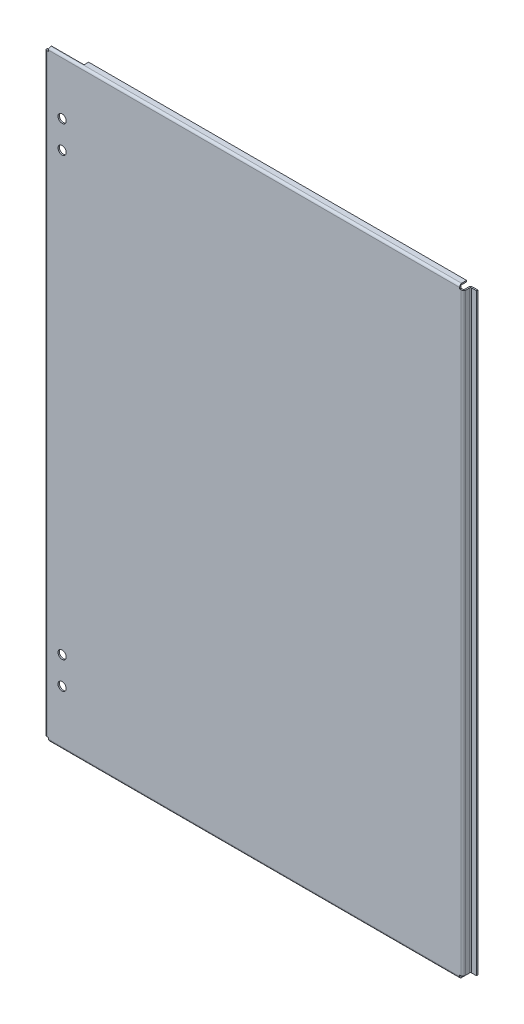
ISO-10303-21;
HEADER;
FILE_DESCRIPTION(('STEP AP214'),'2;1');
FILE_NAME('part.step','',(''),(''),'','','');
FILE_SCHEMA(('AUTOMOTIVE_DESIGN { 1 0 10303 214 1 1 1 1 }'));
ENDSEC;
DATA;
#1=APPLICATION_CONTEXT('core data for automotive mechanical design processes');
#2=APPLICATION_PROTOCOL_DEFINITION('international standard','automotive_design',2000,#1);
#3=PRODUCT_CONTEXT('',#1,'mechanical');
#4=PRODUCT('Part','Part','',(#3));
#5=PRODUCT_RELATED_PRODUCT_CATEGORY('part','',(#4));
#6=PRODUCT_DEFINITION_FORMATION('','',#4);
#7=PRODUCT_DEFINITION_CONTEXT('part definition',#1,'design');
#8=PRODUCT_DEFINITION('design','',#6,#7);
#9=PRODUCT_DEFINITION_SHAPE('','',#8);
#10=(LENGTH_UNIT() NAMED_UNIT(*) SI_UNIT(.MILLI.,.METRE.));
#11=(NAMED_UNIT(*) PLANE_ANGLE_UNIT() SI_UNIT($,.RADIAN.));
#12=(NAMED_UNIT(*) SI_UNIT($,.STERADIAN.) SOLID_ANGLE_UNIT());
#13=UNCERTAINTY_MEASURE_WITH_UNIT(LENGTH_MEASURE(1.E-05),#10,'distance_accuracy_value','');
#14=(GEOMETRIC_REPRESENTATION_CONTEXT(3) GLOBAL_UNCERTAINTY_ASSIGNED_CONTEXT((#13)) GLOBAL_UNIT_ASSIGNED_CONTEXT((#10,
#11,#12)) REPRESENTATION_CONTEXT('',''));
#15=CARTESIAN_POINT('',(0.,0.,0.));
#16=DIRECTION('',(0.,0.,1.));
#17=DIRECTION('',(1.,0.,0.));
#18=AXIS2_PLACEMENT_3D('',#15,#16,#17);
#19=CARTESIAN_POINT('',(0.,0.,7.59650586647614E-13));
#20=DIRECTION('',(0.,0.,-1.));
#21=DIRECTION('',(-1.,0.,0.));
#22=AXIS2_PLACEMENT_3D('',#19,#20,#21);
#23=PLANE('',#22);
#24=DIRECTION('',(1.,0.,0.));
#25=VECTOR('',#24,1.);
#26=CARTESIAN_POINT('',(235.5,-324.585786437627,-1.02565525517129E-13));
#27=LINE('',#26,#25);
#28=CARTESIAN_POINT('',(235.5,-324.585786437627,0.));
#29=VERTEX_POINT('',#28);
#30=CARTESIAN_POINT('',(230.,-324.585786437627,0.));
#31=VERTEX_POINT('',#30);
#32=EDGE_CURVE('E337',#29,#31,#27,.F.);
#33=ORIENTED_EDGE('',*,*,#32,.F.);
#34=DIRECTION('',(0.,1.,0.));
#35=VECTOR('',#34,1.);
#36=CARTESIAN_POINT('',(235.5,324.585786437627,0.));
#37=LINE('',#36,#35);
#38=CARTESIAN_POINT('',(235.5,324.585786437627,0.));
#39=VERTEX_POINT('',#38);
#40=EDGE_CURVE('E185',#39,#29,#37,.F.);
#41=ORIENTED_EDGE('',*,*,#40,.F.);
#42=DIRECTION('',(-1.,0.,0.));
#43=VECTOR('',#42,1.);
#44=CARTESIAN_POINT('',(229.,324.585786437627,0.));
#45=LINE('',#44,#43);
#46=CARTESIAN_POINT('',(230.,324.585786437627,0.));
#47=VERTEX_POINT('',#46);
#48=EDGE_CURVE('E320',#47,#39,#45,.F.);
#49=ORIENTED_EDGE('',*,*,#48,.F.);
#50=DIRECTION('',(0.,1.,0.));
#51=VECTOR('',#50,1.);
#52=CARTESIAN_POINT('',(230.,324.585786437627,0.));
#53=LINE('',#52,#51);
#54=EDGE_CURVE('E176',#47,#31,#53,.F.);
#55=ORIENTED_EDGE('',*,*,#54,.T.);
#56=EDGE_LOOP('',(#33,#41,#49,#55));
#57=FACE_BOUND('',#56,.T.);
#58=ADVANCED_FACE('F17',(#57),#23,.F.);
#59=CARTESIAN_POINT('',(235.5,324.585786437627,-1.50000000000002));
#60=DIRECTION('',(1.,0.,0.));
#61=DIRECTION('',(0.,0.,-1.));
#62=AXIS2_PLACEMENT_3D('',#59,#60,#61);
#63=PLANE('',#62);
#64=DIRECTION('',(0.,1.,0.));
#65=VECTOR('',#64,1.);
#66=CARTESIAN_POINT('',(235.5,0.,-1.50000000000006));
#67=LINE('',#66,#65);
#68=CARTESIAN_POINT('',(235.5,324.585786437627,-1.50000000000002));
#69=VERTEX_POINT('',#68);
#70=CARTESIAN_POINT('',(235.5,-324.585786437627,-1.5000000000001));
#71=VERTEX_POINT('',#70);
#72=EDGE_CURVE('E308',#69,#71,#67,.F.);
#73=ORIENTED_EDGE('',*,*,#72,.F.);
#74=DIRECTION('',(0.,0.,-1.));
#75=VECTOR('',#74,1.);
#76=CARTESIAN_POINT('',(235.5,324.585786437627,-1.50000000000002));
#77=LINE('',#76,#75);
#78=EDGE_CURVE('E316',#69,#39,#77,.F.);
#79=ORIENTED_EDGE('',*,*,#78,.T.);
#80=ORIENTED_EDGE('',*,*,#40,.T.);
#81=DIRECTION('',(0.,0.,-1.));
#82=VECTOR('',#81,1.);
#83=CARTESIAN_POINT('',(235.5,-324.585786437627,-1.50000000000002));
#84=LINE('',#83,#82);
#85=EDGE_CURVE('E321',#29,#71,#84,.T.);
#86=ORIENTED_EDGE('',*,*,#85,.T.);
#87=EDGE_LOOP('',(#73,#79,#80,#86));
#88=FACE_BOUND('',#87,.T.);
#89=ADVANCED_FACE('F323',(#88),#63,.T.);
#90=CARTESIAN_POINT('',(230.,324.585786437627,1.00000000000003));
#91=DIRECTION('',(0.,1.,0.));
#92=DIRECTION('',(0.,0.,1.));
#93=AXIS2_PLACEMENT_3D('',#90,#91,#92);
#94=CYLINDRICAL_SURFACE('',#93,0.999999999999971);
#95=CARTESIAN_POINT('',(230.,-324.585786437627,0.999999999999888));
#96=DIRECTION('',(0.,1.,0.));
#97=DIRECTION('',(0.,0.,1.));
#98=AXIS2_PLACEMENT_3D('',#95,#96,#97);
#99=CIRCLE('',#98,0.999999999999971);
#100=CARTESIAN_POINT('',(229.,-324.585786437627,0.999999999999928));
#101=VERTEX_POINT('',#100);
#102=EDGE_CURVE('E325',#31,#101,#99,.T.);
#103=ORIENTED_EDGE('',*,*,#102,.F.);
#104=ORIENTED_EDGE('',*,*,#54,.F.);
#105=CARTESIAN_POINT('',(230.,324.585786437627,1.00000000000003));
#106=DIRECTION('',(0.,1.,0.));
#107=DIRECTION('',(0.,0.,1.));
#108=AXIS2_PLACEMENT_3D('',#105,#106,#107);
#109=CIRCLE('',#108,0.999999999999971);
#110=CARTESIAN_POINT('',(229.,324.585786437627,1.00000000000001));
#111=VERTEX_POINT('',#110);
#112=EDGE_CURVE('E24',#47,#111,#109,.T.);
#113=ORIENTED_EDGE('',*,*,#112,.T.);
#114=DIRECTION('',(0.,-1.,0.));
#115=VECTOR('',#114,1.);
#116=CARTESIAN_POINT('',(229.,329.,0.999999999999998));
#117=LINE('',#116,#115);
#118=EDGE_CURVE('E327',#111,#101,#117,.T.);
#119=ORIENTED_EDGE('',*,*,#118,.T.);
#120=EDGE_LOOP('',(#103,#104,#113,#119));
#121=FACE_BOUND('',#120,.T.);
#122=ADVANCED_FACE('F642',(#121),#94,.F.);
#123=CARTESIAN_POINT('',(-229.,-329.,8.));
#124=DIRECTION('',(0.,1.,0.));
#125=DIRECTION('',(0.,0.,1.));
#126=AXIS2_PLACEMENT_3D('',#123,#124,#125);
#127=PLANE('',#126);
#128=DIRECTION('',(-1.,0.,0.));
#129=VECTOR('',#128,1.);
#130=CARTESIAN_POINT('',(-229.,-329.,5.));
#131=LINE('',#130,#129);
#132=CARTESIAN_POINT('',(-189.,-329.,5.));
#133=VERTEX_POINT('',#132);
#134=CARTESIAN_POINT('',(-224.585786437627,-329.,5.));
#135=VERTEX_POINT('',#134);
#136=EDGE_CURVE('E812',#133,#135,#131,.T.);
#137=ORIENTED_EDGE('',*,*,#136,.F.);
#138=DIRECTION('',(0.,0.,-1.));
#139=VECTOR('',#138,1.);
#140=CARTESIAN_POINT('',(-189.,-329.,8.));
#141=LINE('',#140,#139);
#142=CARTESIAN_POINT('',(-189.,-329.,0.));
#143=VERTEX_POINT('',#142);
#144=EDGE_CURVE('E823',#133,#143,#141,.T.);
#145=ORIENTED_EDGE('',*,*,#144,.T.);
#146=DIRECTION('',(1.,0.,0.));
#147=VECTOR('',#146,1.);
#148=CARTESIAN_POINT('',(-229.,-329.,0.));
#149=LINE('',#148,#147);
#150=CARTESIAN_POINT('',(224.585786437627,-329.,0.));
#151=VERTEX_POINT('',#150);
#152=EDGE_CURVE('E839',#143,#151,#149,.T.);
#153=ORIENTED_EDGE('',*,*,#152,.T.);
#154=DIRECTION('',(0.,0.,-1.));
#155=VECTOR('',#154,1.);
#156=CARTESIAN_POINT('',(224.585786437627,-329.,0.));
#157=LINE('',#156,#155);
#158=CARTESIAN_POINT('',(224.585786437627,-329.,5.5));
#159=VERTEX_POINT('',#158);
#160=EDGE_CURVE('E842',#159,#151,#157,.T.);
#161=ORIENTED_EDGE('',*,*,#160,.F.);
#162=DIRECTION('',(1.,0.,0.));
#163=VECTOR('',#162,1.);
#164=CARTESIAN_POINT('',(-229.,-329.,5.5));
#165=LINE('',#164,#163);
#166=CARTESIAN_POINT('',(-224.585786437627,-329.,5.5));
#167=VERTEX_POINT('',#166);
#168=EDGE_CURVE('E811',#167,#159,#165,.T.);
#169=ORIENTED_EDGE('',*,*,#168,.F.);
#170=DIRECTION('',(0.,0.,1.));
#171=VECTOR('',#170,1.);
#172=CARTESIAN_POINT('',(-224.585786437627,-329.,6.5));
#173=LINE('',#172,#171);
#174=EDGE_CURVE('E967',#135,#167,#173,.T.);
#175=ORIENTED_EDGE('',*,*,#174,.F.);
#176=EDGE_LOOP('',(#137,#145,#153,#161,#169,#175));
#177=FACE_BOUND('',#176,.T.);
#178=ADVANCED_FACE('F639',(#177),#127,.F.);
#179=CARTESIAN_POINT('',(0.,0.,-1.49999999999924));
#180=DIRECTION('',(0.,0.,-1.));
#181=DIRECTION('',(-1.,0.,0.));
#182=AXIS2_PLACEMENT_3D('',#179,#180,#181);
#183=PLANE('',#182);
#184=DIRECTION('',(-1.,0.,0.));
#185=VECTOR('',#184,1.);
#186=CARTESIAN_POINT('',(0.,324.585786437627,-1.4999999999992));
#187=LINE('',#186,#185);
#188=CARTESIAN_POINT('',(230.,324.585786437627,-1.49999999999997));
#189=VERTEX_POINT('',#188);
#190=EDGE_CURVE('E304',#189,#69,#187,.F.);
#191=ORIENTED_EDGE('',*,*,#190,.T.);
#192=ORIENTED_EDGE('',*,*,#72,.T.);
#193=DIRECTION('',(-1.,0.,0.));
#194=VECTOR('',#193,1.);
#195=CARTESIAN_POINT('',(0.,-324.585786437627,-1.49999999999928));
#196=LINE('',#195,#194);
#197=CARTESIAN_POINT('',(230.,-324.585786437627,-1.50000000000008));
#198=VERTEX_POINT('',#197);
#199=EDGE_CURVE('E314',#71,#198,#196,.T.);
#200=ORIENTED_EDGE('',*,*,#199,.T.);
#201=DIRECTION('',(0.,1.,0.));
#202=VECTOR('',#201,1.);
#203=CARTESIAN_POINT('',(230.,324.585786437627,-1.49999999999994));
#204=LINE('',#203,#202);
#205=EDGE_CURVE('E311',#189,#198,#204,.F.);
#206=ORIENTED_EDGE('',*,*,#205,.F.);
#207=EDGE_LOOP('',(#191,#192,#200,#206));
#208=FACE_BOUND('',#207,.T.);
#209=ADVANCED_FACE('F306',(#208),#183,.T.);
#210=CARTESIAN_POINT('',(229.,329.,8.));
#211=DIRECTION('',(-1.,0.,0.));
#212=DIRECTION('',(0.,-1.,0.));
#213=AXIS2_PLACEMENT_3D('',#210,#211,#212);
#214=PLANE('',#213);
#215=DIRECTION('',(0.,0.,1.));
#216=VECTOR('',#215,1.);
#217=CARTESIAN_POINT('',(229.,324.585786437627,0.));
#218=LINE('',#217,#216);
#219=CARTESIAN_POINT('',(229.,324.585786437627,5.5));
#220=VERTEX_POINT('',#219);
#221=EDGE_CURVE('E807',#220,#111,#218,.F.);
#222=ORIENTED_EDGE('',*,*,#221,.F.);
#223=DIRECTION('',(0.,1.,0.));
#224=VECTOR('',#223,1.);
#225=CARTESIAN_POINT('',(229.,329.,5.5));
#226=LINE('',#225,#224);
#227=CARTESIAN_POINT('',(229.,-324.585786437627,5.5));
#228=VERTEX_POINT('',#227);
#229=EDGE_CURVE('E775',#228,#220,#226,.T.);
#230=ORIENTED_EDGE('',*,*,#229,.F.);
#231=DIRECTION('',(0.,0.,1.));
#232=VECTOR('',#231,1.);
#233=CARTESIAN_POINT('',(229.,-324.585786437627,6.5));
#234=LINE('',#233,#232);
#235=EDGE_CURVE('E794',#101,#228,#234,.T.);
#236=ORIENTED_EDGE('',*,*,#235,.F.);
#237=ORIENTED_EDGE('',*,*,#118,.F.);
#238=EDGE_LOOP('',(#222,#230,#236,#237));
#239=FACE_BOUND('',#238,.T.);
#240=ADVANCED_FACE('F632',(#239),#214,.F.);
#241=CARTESIAN_POINT('',(-229.,329.,8.));
#242=DIRECTION('',(0.,-1.,0.));
#243=DIRECTION('',(0.,0.,-1.));
#244=AXIS2_PLACEMENT_3D('',#241,#242,#243);
#245=PLANE('',#244);
#246=DIRECTION('',(1.,0.,0.));
#247=VECTOR('',#246,1.);
#248=CARTESIAN_POINT('',(-229.,329.,0.));
#249=LINE('',#248,#247);
#250=CARTESIAN_POINT('',(224.585786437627,329.,0.));
#251=VERTEX_POINT('',#250);
#252=CARTESIAN_POINT('',(-189.,329.,0.));
#253=VERTEX_POINT('',#252);
#254=EDGE_CURVE('E778',#251,#253,#249,.F.);
#255=ORIENTED_EDGE('',*,*,#254,.T.);
#256=DIRECTION('',(0.,0.,-1.));
#257=VECTOR('',#256,1.);
#258=CARTESIAN_POINT('',(-189.,329.,8.));
#259=LINE('',#258,#257);
#260=CARTESIAN_POINT('',(-189.,329.,5.));
#261=VERTEX_POINT('',#260);
#262=EDGE_CURVE('E769',#253,#261,#259,.F.);
#263=ORIENTED_EDGE('',*,*,#262,.T.);
#264=DIRECTION('',(1.,0.,0.));
#265=VECTOR('',#264,1.);
#266=CARTESIAN_POINT('',(-229.,329.,5.));
#267=LINE('',#266,#265);
#268=CARTESIAN_POINT('',(-224.585786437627,329.,5.));
#269=VERTEX_POINT('',#268);
#270=EDGE_CURVE('E766',#261,#269,#267,.F.);
#271=ORIENTED_EDGE('',*,*,#270,.T.);
#272=DIRECTION('',(0.,0.,1.));
#273=VECTOR('',#272,1.);
#274=CARTESIAN_POINT('',(-224.585786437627,329.,5.));
#275=LINE('',#274,#273);
#276=CARTESIAN_POINT('',(-224.585786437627,329.,5.5));
#277=VERTEX_POINT('',#276);
#278=EDGE_CURVE('E939',#277,#269,#275,.F.);
#279=ORIENTED_EDGE('',*,*,#278,.F.);
#280=DIRECTION('',(-1.,0.,0.));
#281=VECTOR('',#280,1.);
#282=CARTESIAN_POINT('',(-229.,329.,5.5));
#283=LINE('',#282,#281);
#284=CARTESIAN_POINT('',(224.585786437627,329.,5.5));
#285=VERTEX_POINT('',#284);
#286=EDGE_CURVE('E936',#285,#277,#283,.T.);
#287=ORIENTED_EDGE('',*,*,#286,.F.);
#288=DIRECTION('',(0.,0.,-1.));
#289=VECTOR('',#288,1.);
#290=CARTESIAN_POINT('',(224.585786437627,329.,6.5));
#291=LINE('',#290,#289);
#292=EDGE_CURVE('E773',#251,#285,#291,.F.);
#293=ORIENTED_EDGE('',*,*,#292,.F.);
#294=EDGE_LOOP('',(#255,#263,#271,#279,#287,#293));
#295=FACE_BOUND('',#294,.T.);
#296=ADVANCED_FACE('F628',(#295),#245,.F.);
#297=CARTESIAN_POINT('',(-229.,329.,8.));
#298=DIRECTION('',(1.,0.,0.));
#299=DIRECTION('',(0.,1.,0.));
#300=AXIS2_PLACEMENT_3D('',#297,#298,#299);
#301=PLANE('',#300);
#302=DIRECTION('',(0.,1.,0.));
#303=VECTOR('',#302,1.);
#304=CARTESIAN_POINT('',(-229.,329.,5.));
#305=LINE('',#304,#303);
#306=CARTESIAN_POINT('',(-229.,324.585786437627,5.));
#307=VERTEX_POINT('',#306);
#308=CARTESIAN_POINT('',(-229.,289.,5.));
#309=VERTEX_POINT('',#308);
#310=EDGE_CURVE('E1024',#307,#309,#305,.F.);
#311=ORIENTED_EDGE('',*,*,#310,.T.);
#312=DIRECTION('',(0.,0.,1.));
#313=VECTOR('',#312,1.);
#314=CARTESIAN_POINT('',(-229.,289.,8.));
#315=LINE('',#314,#313);
#316=CARTESIAN_POINT('',(-229.,289.,0.));
#317=VERTEX_POINT('',#316);
#318=EDGE_CURVE('E748',#309,#317,#315,.F.);
#319=ORIENTED_EDGE('',*,*,#318,.T.);
#320=DIRECTION('',(0.,1.,0.));
#321=VECTOR('',#320,1.);
#322=CARTESIAN_POINT('',(-229.,329.,0.));
#323=LINE('',#322,#321);
#324=CARTESIAN_POINT('',(-229.,-289.,0.));
#325=VERTEX_POINT('',#324);
#326=EDGE_CURVE('E745',#317,#325,#323,.F.);
#327=ORIENTED_EDGE('',*,*,#326,.T.);
#328=DIRECTION('',(0.,0.,1.));
#329=VECTOR('',#328,1.);
#330=CARTESIAN_POINT('',(-229.,-289.,8.));
#331=LINE('',#330,#329);
#332=CARTESIAN_POINT('',(-229.,-289.,5.));
#333=VERTEX_POINT('',#332);
#334=EDGE_CURVE('E733',#325,#333,#331,.T.);
#335=ORIENTED_EDGE('',*,*,#334,.T.);
#336=DIRECTION('',(0.,1.,0.));
#337=VECTOR('',#336,1.);
#338=CARTESIAN_POINT('',(-229.,329.,5.));
#339=LINE('',#338,#337);
#340=CARTESIAN_POINT('',(-229.,-324.585786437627,5.));
#341=VERTEX_POINT('',#340);
#342=EDGE_CURVE('E742',#341,#333,#339,.T.);
#343=ORIENTED_EDGE('',*,*,#342,.F.);
#344=DIRECTION('',(0.,0.,1.));
#345=VECTOR('',#344,1.);
#346=CARTESIAN_POINT('',(-229.,-324.585786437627,5.));
#347=LINE('',#346,#345);
#348=CARTESIAN_POINT('',(-229.,-324.585786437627,5.5));
#349=VERTEX_POINT('',#348);
#350=EDGE_CURVE('E912',#349,#341,#347,.F.);
#351=ORIENTED_EDGE('',*,*,#350,.F.);
#352=DIRECTION('',(0.,-1.,0.));
#353=VECTOR('',#352,1.);
#354=CARTESIAN_POINT('',(-229.,329.,5.5));
#355=LINE('',#354,#353);
#356=CARTESIAN_POINT('',(-229.,324.585786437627,5.5));
#357=VERTEX_POINT('',#356);
#358=EDGE_CURVE('E904',#357,#349,#355,.T.);
#359=ORIENTED_EDGE('',*,*,#358,.F.);
#360=DIRECTION('',(0.,0.,1.));
#361=VECTOR('',#360,1.);
#362=CARTESIAN_POINT('',(-229.,324.585786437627,6.5));
#363=LINE('',#362,#361);
#364=EDGE_CURVE('E907',#307,#357,#363,.T.);
#365=ORIENTED_EDGE('',*,*,#364,.F.);
#366=EDGE_LOOP('',(#311,#319,#327,#335,#343,#351,#359,#365));
#367=FACE_BOUND('',#366,.T.);
#368=ADVANCED_FACE('F624',(#367),#301,.F.);
#369=CARTESIAN_POINT('',(224.585786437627,-327.5,0.));
#370=DIRECTION('',(1.,0.,0.));
#371=DIRECTION('',(0.,0.,-1.));
#372=AXIS2_PLACEMENT_3D('',#369,#370,#371);
#373=PLANE('',#372);
#374=DIRECTION('',(0.,1.,0.));
#375=VECTOR('',#374,1.);
#376=CARTESIAN_POINT('',(224.585786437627,-327.5,0.));
#377=LINE('',#376,#375);
#378=CARTESIAN_POINT('',(224.585786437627,-327.5,0.));
#379=VERTEX_POINT('',#378);
#380=EDGE_CURVE('E826',#151,#379,#377,.T.);
#381=ORIENTED_EDGE('',*,*,#380,.T.);
#382=DIRECTION('',(0.,0.,1.));
#383=VECTOR('',#382,1.);
#384=CARTESIAN_POINT('',(224.585786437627,-327.5,8.));
#385=LINE('',#384,#383);
#386=CARTESIAN_POINT('',(224.585786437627,-327.5,5.5));
#387=VERTEX_POINT('',#386);
#388=EDGE_CURVE('E897',#387,#379,#385,.F.);
#389=ORIENTED_EDGE('',*,*,#388,.F.);
#390=DIRECTION('',(0.,1.,0.));
#391=VECTOR('',#390,1.);
#392=CARTESIAN_POINT('',(224.585786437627,-327.5,5.5));
#393=LINE('',#392,#391);
#394=EDGE_CURVE('E799',#387,#159,#393,.F.);
#395=ORIENTED_EDGE('',*,*,#394,.T.);
#396=ORIENTED_EDGE('',*,*,#160,.T.);
#397=EDGE_LOOP('',(#381,#389,#395,#396));
#398=FACE_BOUND('',#397,.T.);
#399=ADVANCED_FACE('F620',(#398),#373,.T.);
#400=CARTESIAN_POINT('',(-229.,-327.5,0.));
#401=DIRECTION('',(0.,0.,1.));
#402=DIRECTION('',(1.,0.,0.));
#403=AXIS2_PLACEMENT_3D('',#400,#401,#402);
#404=PLANE('',#403);
#405=ORIENTED_EDGE('',*,*,#152,.F.);
#406=DIRECTION('',(0.,1.,0.));
#407=VECTOR('',#406,1.);
#408=CARTESIAN_POINT('',(-189.,-327.5,0.));
#409=LINE('',#408,#407);
#410=CARTESIAN_POINT('',(-189.,-327.5,0.));
#411=VERTEX_POINT('',#410);
#412=EDGE_CURVE('E820',#143,#411,#409,.T.);
#413=ORIENTED_EDGE('',*,*,#412,.T.);
#414=DIRECTION('',(1.,0.,0.));
#415=VECTOR('',#414,1.);
#416=CARTESIAN_POINT('',(-229.,-327.5,0.));
#417=LINE('',#416,#415);
#418=EDGE_CURVE('E832',#379,#411,#417,.F.);
#419=ORIENTED_EDGE('',*,*,#418,.F.);
#420=ORIENTED_EDGE('',*,*,#380,.F.);
#421=EDGE_LOOP('',(#405,#413,#419,#420));
#422=FACE_BOUND('',#421,.T.);
#423=ADVANCED_FACE('F616',(#422),#404,.F.);
#424=CARTESIAN_POINT('',(-189.,-327.5,8.));
#425=DIRECTION('',(1.,0.,0.));
#426=DIRECTION('',(0.,0.,-1.));
#427=AXIS2_PLACEMENT_3D('',#424,#425,#426);
#428=PLANE('',#427);
#429=ORIENTED_EDGE('',*,*,#144,.F.);
#430=DIRECTION('',(0.,1.,0.));
#431=VECTOR('',#430,1.);
#432=CARTESIAN_POINT('',(-189.,-327.5,5.));
#433=LINE('',#432,#431);
#434=CARTESIAN_POINT('',(-189.,-327.5,5.));
#435=VERTEX_POINT('',#434);
#436=EDGE_CURVE('E815',#435,#133,#433,.F.);
#437=ORIENTED_EDGE('',*,*,#436,.F.);
#438=DIRECTION('',(0.,0.,1.));
#439=VECTOR('',#438,1.);
#440=CARTESIAN_POINT('',(-189.,-327.5,8.));
#441=LINE('',#440,#439);
#442=EDGE_CURVE('E829',#411,#435,#441,.T.);
#443=ORIENTED_EDGE('',*,*,#442,.F.);
#444=ORIENTED_EDGE('',*,*,#412,.F.);
#445=EDGE_LOOP('',(#429,#437,#443,#444));
#446=FACE_BOUND('',#445,.T.);
#447=ADVANCED_FACE('F612',(#446),#428,.F.);
#448=CARTESIAN_POINT('',(-229.,-327.5,5.));
#449=DIRECTION('',(0.,0.,-1.));
#450=DIRECTION('',(-1.,0.,0.));
#451=AXIS2_PLACEMENT_3D('',#448,#449,#450);
#452=PLANE('',#451);
#453=DIRECTION('',(0.,1.,0.));
#454=VECTOR('',#453,1.);
#455=CARTESIAN_POINT('',(-224.585786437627,-327.5,5.));
#456=LINE('',#455,#454);
#457=CARTESIAN_POINT('',(-224.585786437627,-327.5,5.));
#458=VERTEX_POINT('',#457);
#459=EDGE_CURVE('E814',#458,#135,#456,.F.);
#460=ORIENTED_EDGE('',*,*,#459,.F.);
#461=DIRECTION('',(1.,0.,0.));
#462=VECTOR('',#461,1.);
#463=CARTESIAN_POINT('',(-229.,-327.5,5.));
#464=LINE('',#463,#462);
#465=EDGE_CURVE('E831',#435,#458,#464,.F.);
#466=ORIENTED_EDGE('',*,*,#465,.F.);
#467=ORIENTED_EDGE('',*,*,#436,.T.);
#468=ORIENTED_EDGE('',*,*,#136,.T.);
#469=EDGE_LOOP('',(#460,#466,#467,#468));
#470=FACE_BOUND('',#469,.T.);
#471=ADVANCED_FACE('F608',(#470),#452,.T.);
#472=CARTESIAN_POINT('',(-224.585786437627,-327.5,6.5));
#473=DIRECTION('',(-1.,0.,0.));
#474=DIRECTION('',(0.,0.,1.));
#475=AXIS2_PLACEMENT_3D('',#472,#473,#474);
#476=PLANE('',#475);
#477=DIRECTION('',(0.,-1.,0.));
#478=VECTOR('',#477,1.);
#479=CARTESIAN_POINT('',(-224.585786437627,-328.25,5.5));
#480=LINE('',#479,#478);
#481=CARTESIAN_POINT('',(-224.585786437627,-327.5,5.5));
#482=VERTEX_POINT('',#481);
#483=EDGE_CURVE('E594',#482,#167,#480,.T.);
#484=ORIENTED_EDGE('',*,*,#483,.F.);
#485=DIRECTION('',(0.,0.,1.));
#486=VECTOR('',#485,1.);
#487=CARTESIAN_POINT('',(-224.585786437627,-327.5,8.));
#488=LINE('',#487,#486);
#489=EDGE_CURVE('E895',#458,#482,#488,.T.);
#490=ORIENTED_EDGE('',*,*,#489,.F.);
#491=ORIENTED_EDGE('',*,*,#459,.T.);
#492=ORIENTED_EDGE('',*,*,#174,.T.);
#493=EDGE_LOOP('',(#484,#490,#491,#492));
#494=FACE_BOUND('',#493,.T.);
#495=ADVANCED_FACE('F603',(#494),#476,.T.);
#496=CARTESIAN_POINT('',(-229.,-326.5,5.5));
#497=DIRECTION('',(1.,0.,0.));
#498=DIRECTION('',(0.,0.,-1.));
#499=AXIS2_PLACEMENT_3D('',#496,#497,#498);
#500=CYLINDRICAL_SURFACE('',#499,2.5);
#501=CARTESIAN_POINT('',(225.,-326.5,8.));
#502=CARTESIAN_POINT('',(224.999990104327,-326.564964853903,8.00000716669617));
#503=CARTESIAN_POINT('',(224.998839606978,-326.629914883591,7.99746790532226));
#504=CARTESIAN_POINT('',(224.994583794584,-326.759332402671,7.98735772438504));
#505=CARTESIAN_POINT('',(224.991479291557,-326.823800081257,7.97978889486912));
#506=CARTESIAN_POINT('',(224.983649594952,-326.95171922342,7.95970195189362));
#507=CARTESIAN_POINT('',(224.978927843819,-327.015172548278,7.94719434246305));
#508=CARTESIAN_POINT('',(224.96812996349,-327.140803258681,7.91734262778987));
#509=CARTESIAN_POINT('',(224.962053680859,-327.202980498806,7.8999979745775));
#510=CARTESIAN_POINT('',(224.941762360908,-327.390804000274,7.83967369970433));
#511=CARTESIAN_POINT('',(224.925746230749,-327.513884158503,7.78900635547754));
#512=CARTESIAN_POINT('',(224.89083277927,-327.750137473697,7.6690432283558));
#513=CARTESIAN_POINT('',(224.871933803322,-327.863304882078,7.59973672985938));
#514=CARTESIAN_POINT('',(224.831621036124,-328.08328699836,7.43977461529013));
#515=CARTESIAN_POINT('',(224.810125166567,-328.189364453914,7.34812208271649));
#516=CARTESIAN_POINT('',(224.767235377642,-328.384777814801,7.14837717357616));
#517=CARTESIAN_POINT('',(224.745841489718,-328.474108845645,7.04028002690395));
#518=CARTESIAN_POINT('',(224.704466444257,-328.635002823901,6.80844024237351));
#519=CARTESIAN_POINT('',(224.684516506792,-328.706227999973,6.68445721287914));
#520=CARTESIAN_POINT('',(224.648372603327,-328.82663662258,6.42578882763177));
#521=CARTESIAN_POINT('',(224.632175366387,-328.875839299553,6.29111293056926));
#522=CARTESIAN_POINT('',(224.608970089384,-328.941905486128,6.04696003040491));
#523=CARTESIAN_POINT('',(224.60070102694,-328.963628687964,5.93890652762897));
#524=CARTESIAN_POINT('',(224.592011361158,-328.985416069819,5.77521638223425));
#525=CARTESIAN_POINT('',(224.589733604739,-328.990878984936,5.72035946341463));
#526=CARTESIAN_POINT('',(224.586623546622,-328.99817269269,5.61034185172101));
#527=CARTESIAN_POINT('',(224.585791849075,-329.000001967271,5.55518104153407));
#528=CARTESIAN_POINT('',(224.585786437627,-329.,5.5));
#529=B_SPLINE_CURVE_WITH_KNOTS('',3,(#501,#502,#503,#504,#505,#506,#507,#508,#509,#510,#511,
#512,#513,#514,#515,#516,#517,#518,#519,#520,#521,#522,#523,#524,#525,#526,#527,#528),
.UNSPECIFIED.,.F.,.F.,(4,2,2,2,2,2,2,2,2,2,2,2,2,4),(0.,0.19481270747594,0.38954451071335,
0.583864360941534,0.778206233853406,1.17849622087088,1.57901682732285,2.0025220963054,
2.42615044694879,2.85718159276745,3.28783561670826,3.61833762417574,3.78373858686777,
3.94920863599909),.UNSPECIFIED.);
#530=CARTESIAN_POINT('',(225.,-326.5,8.));
#531=VERTEX_POINT('',#530);
#532=EDGE_CURVE('E588',#531,#159,#529,.T.);
#533=ORIENTED_EDGE('',*,*,#532,.F.);
#534=DIRECTION('',(1.,0.,0.));
#535=VECTOR('',#534,1.);
#536=CARTESIAN_POINT('',(0.,-326.5,8.));
#537=LINE('',#536,#535);
#538=CARTESIAN_POINT('',(-225.,-326.5,8.));
#539=VERTEX_POINT('',#538);
#540=EDGE_CURVE('E1017',#539,#531,#537,.T.);
#541=ORIENTED_EDGE('',*,*,#540,.F.);
#542=CARTESIAN_POINT('',(-224.585786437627,-329.,5.5));
#543=CARTESIAN_POINT('',(-224.5857963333,-329.000007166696,5.56496485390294));
#544=CARTESIAN_POINT('',(-224.586946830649,-328.997467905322,5.62991488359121));
#545=CARTESIAN_POINT('',(-224.591202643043,-328.987357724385,5.75933240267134));
#546=CARTESIAN_POINT('',(-224.594307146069,-328.979788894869,5.82380008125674));
#547=CARTESIAN_POINT('',(-224.602136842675,-328.959701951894,5.95171922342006));
#548=CARTESIAN_POINT('',(-224.606858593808,-328.947194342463,6.01517254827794));
#549=CARTESIAN_POINT('',(-224.617656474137,-328.91734262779,6.140803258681));
#550=CARTESIAN_POINT('',(-224.623732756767,-328.899997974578,6.20298049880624));
#551=CARTESIAN_POINT('',(-224.644024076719,-328.839673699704,6.39080400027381));
#552=CARTESIAN_POINT('',(-224.660040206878,-328.789006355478,6.51388415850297));
#553=CARTESIAN_POINT('',(-224.694953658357,-328.669043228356,6.75013747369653));
#554=CARTESIAN_POINT('',(-224.713852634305,-328.599736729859,6.86330488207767));
#555=CARTESIAN_POINT('',(-224.754165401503,-328.43977461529,7.08328699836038));
#556=CARTESIAN_POINT('',(-224.77566127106,-328.348122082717,7.1893644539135));
#557=CARTESIAN_POINT('',(-224.818551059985,-328.148377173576,7.3847778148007));
#558=CARTESIAN_POINT('',(-224.839944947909,-328.040280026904,7.47410884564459));
#559=CARTESIAN_POINT('',(-224.88131999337,-327.808440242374,7.6350028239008));
#560=CARTESIAN_POINT('',(-224.901269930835,-327.684457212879,7.70622799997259));
#561=CARTESIAN_POINT('',(-224.9374138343,-327.425788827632,7.82663662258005));
#562=CARTESIAN_POINT('',(-224.95361107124,-327.291112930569,7.8758392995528));
#563=CARTESIAN_POINT('',(-224.976816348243,-327.046960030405,7.94190548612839));
#564=CARTESIAN_POINT('',(-224.985085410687,-326.938906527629,7.96362868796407));
#565=CARTESIAN_POINT('',(-224.993775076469,-326.775216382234,7.98541606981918));
#566=CARTESIAN_POINT('',(-224.996052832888,-326.720359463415,7.99087898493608));
#567=CARTESIAN_POINT('',(-224.999162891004,-326.610341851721,7.99817269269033));
#568=CARTESIAN_POINT('',(-224.999994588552,-326.555181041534,8.0000019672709));
#569=CARTESIAN_POINT('',(-225.,-326.5,8.));
#570=B_SPLINE_CURVE_WITH_KNOTS('',3,(#542,#543,#544,#545,#546,#547,#548,#549,#550,#551,#552,
#553,#554,#555,#556,#557,#558,#559,#560,#561,#562,#563,#564,#565,#566,#567,#568,#569),
.UNSPECIFIED.,.F.,.F.,(4,2,2,2,2,2,2,2,2,2,2,2,2,4),(0.,0.194812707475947,0.389544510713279,
0.583864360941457,0.778206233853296,1.17849622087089,1.5790168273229,2.00252209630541,
2.42615044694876,2.85718159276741,3.28783561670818,3.61833762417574,3.78373858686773,
3.94920863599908),.UNSPECIFIED.);
#571=EDGE_CURVE('E504',#167,#539,#570,.T.);
#572=ORIENTED_EDGE('',*,*,#571,.F.);
#573=ORIENTED_EDGE('',*,*,#168,.T.);
#574=EDGE_LOOP('',(#533,#541,#572,#573));
#575=FACE_BOUND('',#574,.T.);
#576=ADVANCED_FACE('F598',(#575),#500,.T.);
#577=CARTESIAN_POINT('',(227.5,324.585786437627,0.));
#578=DIRECTION('',(0.,1.,0.));
#579=DIRECTION('',(-1.,0.,0.));
#580=AXIS2_PLACEMENT_3D('',#577,#578,#579);
#581=PLANE('',#580);
#582=DIRECTION('',(0.,0.,1.));
#583=VECTOR('',#582,1.);
#584=CARTESIAN_POINT('',(227.5,324.585786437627,8.));
#585=LINE('',#584,#583);
#586=CARTESIAN_POINT('',(227.5,324.585786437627,5.5));
#587=VERTEX_POINT('',#586);
#588=CARTESIAN_POINT('',(227.5,324.585786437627,0.999999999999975));
#589=VERTEX_POINT('',#588);
#590=EDGE_CURVE('E889',#587,#589,#585,.F.);
#591=ORIENTED_EDGE('',*,*,#590,.F.);
#592=DIRECTION('',(-1.,0.,0.));
#593=VECTOR('',#592,1.);
#594=CARTESIAN_POINT('',(227.5,324.585786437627,5.5));
#595=LINE('',#594,#593);
#596=EDGE_CURVE('E810',#587,#220,#595,.F.);
#597=ORIENTED_EDGE('',*,*,#596,.T.);
#598=ORIENTED_EDGE('',*,*,#221,.T.);
#599=ORIENTED_EDGE('',*,*,#112,.F.);
#600=ORIENTED_EDGE('',*,*,#48,.T.);
#601=ORIENTED_EDGE('',*,*,#78,.F.);
#602=ORIENTED_EDGE('',*,*,#190,.F.);
#603=CARTESIAN_POINT('',(230.,324.585786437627,1.00000000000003));
#604=DIRECTION('',(0.,1.,0.));
#605=DIRECTION('',(0.,0.,1.));
#606=AXIS2_PLACEMENT_3D('',#603,#604,#605);
#607=CIRCLE('',#606,2.49999999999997);
#608=EDGE_CURVE('E801',#589,#189,#607,.F.);
#609=ORIENTED_EDGE('',*,*,#608,.F.);
#610=EDGE_LOOP('',(#591,#597,#598,#599,#600,#601,#602,#609));
#611=FACE_BOUND('',#610,.T.);
#612=ADVANCED_FACE('F318',(#611),#581,.T.);
#613=CARTESIAN_POINT('',(230.,324.585786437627,1.00000000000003));
#614=DIRECTION('',(0.,1.,0.));
#615=DIRECTION('',(0.,0.,1.));
#616=AXIS2_PLACEMENT_3D('',#613,#614,#615);
#617=CYLINDRICAL_SURFACE('',#616,2.49999999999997);
#618=ORIENTED_EDGE('',*,*,#205,.T.);
#619=CARTESIAN_POINT('',(230.,-324.585786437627,0.999999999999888));
#620=DIRECTION('',(0.,1.,0.));
#621=DIRECTION('',(0.,0.,1.));
#622=AXIS2_PLACEMENT_3D('',#619,#620,#621);
#623=CIRCLE('',#622,2.49999999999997);
#624=CARTESIAN_POINT('',(227.5,-324.585786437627,0.999999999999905));
#625=VERTEX_POINT('',#624);
#626=EDGE_CURVE('E596',#198,#625,#623,.T.);
#627=ORIENTED_EDGE('',*,*,#626,.T.);
#628=DIRECTION('',(0.,-1.,0.));
#629=VECTOR('',#628,1.);
#630=CARTESIAN_POINT('',(227.5,329.,0.999999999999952));
#631=LINE('',#630,#629);
#632=EDGE_CURVE('E888',#589,#625,#631,.T.);
#633=ORIENTED_EDGE('',*,*,#632,.F.);
#634=ORIENTED_EDGE('',*,*,#608,.T.);
#635=EDGE_LOOP('',(#618,#627,#633,#634));
#636=FACE_BOUND('',#635,.T.);
#637=ADVANCED_FACE('F1332',(#636),#617,.T.);
#638=CARTESIAN_POINT('',(227.5,-324.585786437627,6.5));
#639=DIRECTION('',(0.,-1.,0.));
#640=DIRECTION('',(1.,0.,0.));
#641=AXIS2_PLACEMENT_3D('',#638,#639,#640);
#642=PLANE('',#641);
#643=DIRECTION('',(1.,0.,0.));
#644=VECTOR('',#643,1.);
#645=CARTESIAN_POINT('',(227.5,-324.585786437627,5.5));
#646=LINE('',#645,#644);
#647=CARTESIAN_POINT('',(227.5,-324.585786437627,5.5));
#648=VERTEX_POINT('',#647);
#649=EDGE_CURVE('E796',#228,#648,#646,.F.);
#650=ORIENTED_EDGE('',*,*,#649,.T.);
#651=DIRECTION('',(0.,0.,1.));
#652=VECTOR('',#651,1.);
#653=CARTESIAN_POINT('',(227.5,-324.585786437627,8.));
#654=LINE('',#653,#652);
#655=EDGE_CURVE('E886',#625,#648,#654,.T.);
#656=ORIENTED_EDGE('',*,*,#655,.F.);
#657=ORIENTED_EDGE('',*,*,#626,.F.);
#658=ORIENTED_EDGE('',*,*,#199,.F.);
#659=ORIENTED_EDGE('',*,*,#85,.F.);
#660=ORIENTED_EDGE('',*,*,#32,.T.);
#661=ORIENTED_EDGE('',*,*,#102,.T.);
#662=ORIENTED_EDGE('',*,*,#235,.T.);
#663=EDGE_LOOP('',(#650,#656,#657,#658,#659,#660,#661,#662));
#664=FACE_BOUND('',#663,.T.);
#665=ADVANCED_FACE('F493',(#664),#642,.T.);
#666=CARTESIAN_POINT('',(226.5,329.,5.5));
#667=DIRECTION('',(0.,1.,0.));
#668=DIRECTION('',(-1.,0.,0.));
#669=AXIS2_PLACEMENT_3D('',#666,#667,#668);
#670=CYLINDRICAL_SURFACE('',#669,2.5);
#671=CARTESIAN_POINT('',(226.5,325.,8.));
#672=CARTESIAN_POINT('',(226.564964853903,324.999990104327,8.00000716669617));
#673=CARTESIAN_POINT('',(226.629914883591,324.998839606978,7.99746790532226));
#674=CARTESIAN_POINT('',(226.759332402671,324.994583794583,7.98735772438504));
#675=CARTESIAN_POINT('',(226.823800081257,324.991479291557,7.97978889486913));
#676=CARTESIAN_POINT('',(226.95171922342,324.983649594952,7.95970195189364));
#677=CARTESIAN_POINT('',(227.015172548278,324.978927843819,7.94719434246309));
#678=CARTESIAN_POINT('',(227.140803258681,324.96812996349,7.91734262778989));
#679=CARTESIAN_POINT('',(227.202980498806,324.96205368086,7.8999979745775));
#680=CARTESIAN_POINT('',(227.390804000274,324.941762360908,7.83967369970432));
#681=CARTESIAN_POINT('',(227.513884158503,324.925746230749,7.78900635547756));
#682=CARTESIAN_POINT('',(227.750137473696,324.89083277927,7.66904322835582));
#683=CARTESIAN_POINT('',(227.863304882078,324.871933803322,7.59973672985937));
#684=CARTESIAN_POINT('',(228.08328699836,324.831621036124,7.4397746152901));
#685=CARTESIAN_POINT('',(228.189364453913,324.810125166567,7.34812208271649));
#686=CARTESIAN_POINT('',(228.384777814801,324.767235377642,7.14837717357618));
#687=CARTESIAN_POINT('',(228.474108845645,324.745841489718,7.04028002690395));
#688=CARTESIAN_POINT('',(228.635002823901,324.704466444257,6.80844024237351));
#689=CARTESIAN_POINT('',(228.706227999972,324.684516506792,6.68445721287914));
#690=CARTESIAN_POINT('',(228.82663662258,324.648372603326,6.42578882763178));
#691=CARTESIAN_POINT('',(228.875839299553,324.632175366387,6.29111293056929));
#692=CARTESIAN_POINT('',(228.941905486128,324.608970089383,6.04696003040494));
#693=CARTESIAN_POINT('',(228.963628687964,324.60070102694,5.938906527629));
#694=CARTESIAN_POINT('',(228.985416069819,324.592011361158,5.77521638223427));
#695=CARTESIAN_POINT('',(228.990878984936,324.589733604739,5.72035946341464));
#696=CARTESIAN_POINT('',(228.99817269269,324.586623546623,5.61034185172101));
#697=CARTESIAN_POINT('',(229.000001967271,324.585791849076,5.55518104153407));
#698=CARTESIAN_POINT('',(229.,324.585786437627,5.5));
#699=B_SPLINE_CURVE_WITH_KNOTS('',3,(#671,#672,#673,#674,#675,#676,#677,#678,#679,#680,#681,
#682,#683,#684,#685,#686,#687,#688,#689,#690,#691,#692,#693,#694,#695,#696,#697,#698),
.UNSPECIFIED.,.F.,.F.,(4,2,2,2,2,2,2,2,2,2,2,2,2,4),(0.,0.194812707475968,0.389544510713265,
0.583864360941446,0.778206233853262,1.17849622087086,1.57901682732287,2.0025220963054,
2.42615044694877,2.85718159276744,3.28783561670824,3.61833762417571,3.78373858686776,
3.94920863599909),.UNSPECIFIED.);
#700=CARTESIAN_POINT('',(226.5,325.,8.));
#701=VERTEX_POINT('',#700);
#702=EDGE_CURVE('E497',#701,#220,#699,.T.);
#703=ORIENTED_EDGE('',*,*,#702,.F.);
#704=DIRECTION('',(0.,1.,0.));
#705=VECTOR('',#704,1.);
#706=CARTESIAN_POINT('',(226.5,0.,8.));
#707=LINE('',#706,#705);
#708=CARTESIAN_POINT('',(226.5,-325.,8.));
#709=VERTEX_POINT('',#708);
#710=EDGE_CURVE('E861',#709,#701,#707,.T.);
#711=ORIENTED_EDGE('',*,*,#710,.F.);
#712=CARTESIAN_POINT('',(229.,-324.585786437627,5.5));
#713=CARTESIAN_POINT('',(229.000007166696,-324.5857963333,5.56496485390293));
#714=CARTESIAN_POINT('',(228.997467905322,-324.586946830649,5.6299148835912));
#715=CARTESIAN_POINT('',(228.987357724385,-324.591202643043,5.75933240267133));
#716=CARTESIAN_POINT('',(228.979788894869,-324.594307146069,5.82380008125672));
#717=CARTESIAN_POINT('',(228.959701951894,-324.602136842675,5.95171922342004));
#718=CARTESIAN_POINT('',(228.947194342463,-324.606858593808,6.01517254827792));
#719=CARTESIAN_POINT('',(228.91734262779,-324.617656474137,6.14080325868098));
#720=CARTESIAN_POINT('',(228.899997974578,-324.623732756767,6.20298049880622));
#721=CARTESIAN_POINT('',(228.839673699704,-324.644024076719,6.39080400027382));
#722=CARTESIAN_POINT('',(228.789006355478,-324.660040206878,6.513884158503));
#723=CARTESIAN_POINT('',(228.669043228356,-324.694953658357,6.75013747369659));
#724=CARTESIAN_POINT('',(228.599736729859,-324.713852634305,6.86330488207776));
#725=CARTESIAN_POINT('',(228.43977461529,-324.754165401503,7.08328699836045));
#726=CARTESIAN_POINT('',(228.348122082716,-324.77566127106,7.18936445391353));
#727=CARTESIAN_POINT('',(228.148377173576,-324.818551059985,7.38477781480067));
#728=CARTESIAN_POINT('',(228.040280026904,-324.839944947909,7.47410884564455));
#729=CARTESIAN_POINT('',(227.808440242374,-324.88131999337,7.63500282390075));
#730=CARTESIAN_POINT('',(227.684457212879,-324.901269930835,7.70622799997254));
#731=CARTESIAN_POINT('',(227.425788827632,-324.937413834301,7.82663662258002));
#732=CARTESIAN_POINT('',(227.291112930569,-324.95361107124,7.87583929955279));
#733=CARTESIAN_POINT('',(227.046960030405,-324.976816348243,7.94190548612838));
#734=CARTESIAN_POINT('',(226.938906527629,-324.985085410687,7.96362868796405));
#735=CARTESIAN_POINT('',(226.775216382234,-324.993775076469,7.98541606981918));
#736=CARTESIAN_POINT('',(226.720359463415,-324.996052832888,7.99087898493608));
#737=CARTESIAN_POINT('',(226.610341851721,-324.999162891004,7.99817269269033));
#738=CARTESIAN_POINT('',(226.555181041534,-324.999994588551,8.0000019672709));
#739=CARTESIAN_POINT('',(226.5,-325.,8.));
#740=B_SPLINE_CURVE_WITH_KNOTS('',3,(#712,#713,#714,#715,#716,#717,#718,#719,#720,#721,#722,
#723,#724,#725,#726,#727,#728,#729,#730,#731,#732,#733,#734,#735,#736,#737,#738,#739),
.UNSPECIFIED.,.F.,.F.,(4,2,2,2,2,2,2,2,2,2,2,2,2,4),(0.,0.194812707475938,0.389544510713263,
0.583864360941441,0.778206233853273,1.17849622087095,1.57901682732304,2.00252209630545,
2.42615044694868,2.85718159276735,3.28783561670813,3.61833762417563,3.78373858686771,
3.94920863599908),.UNSPECIFIED.);
#741=EDGE_CURVE('E455',#228,#709,#740,.T.);
#742=ORIENTED_EDGE('',*,*,#741,.F.);
#743=ORIENTED_EDGE('',*,*,#229,.T.);
#744=EDGE_LOOP('',(#703,#711,#742,#743));
#745=FACE_BOUND('',#744,.T.);
#746=ADVANCED_FACE('F488',(#745),#670,.T.);
#747=CARTESIAN_POINT('',(224.585786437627,327.5,6.5));
#748=DIRECTION('',(1.,0.,0.));
#749=DIRECTION('',(0.,0.,-1.));
#750=AXIS2_PLACEMENT_3D('',#747,#748,#749);
#751=PLANE('',#750);
#752=DIRECTION('',(0.,1.,0.));
#753=VECTOR('',#752,1.);
#754=CARTESIAN_POINT('',(224.585786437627,327.5,5.5));
#755=LINE('',#754,#753);
#756=CARTESIAN_POINT('',(224.585786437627,327.5,5.5));
#757=VERTEX_POINT('',#756);
#758=EDGE_CURVE('E770',#285,#757,#755,.F.);
#759=ORIENTED_EDGE('',*,*,#758,.T.);
#760=DIRECTION('',(0.,0.,-1.));
#761=VECTOR('',#760,1.);
#762=CARTESIAN_POINT('',(224.585786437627,327.5,8.));
#763=LINE('',#762,#761);
#764=CARTESIAN_POINT('',(224.585786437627,327.5,0.));
#765=VERTEX_POINT('',#764);
#766=EDGE_CURVE('E864',#765,#757,#763,.F.);
#767=ORIENTED_EDGE('',*,*,#766,.F.);
#768=DIRECTION('',(0.,1.,0.));
#769=VECTOR('',#768,1.);
#770=CARTESIAN_POINT('',(224.585786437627,327.5,0.));
#771=LINE('',#770,#769);
#772=EDGE_CURVE('E782',#765,#251,#771,.T.);
#773=ORIENTED_EDGE('',*,*,#772,.T.);
#774=ORIENTED_EDGE('',*,*,#292,.T.);
#775=EDGE_LOOP('',(#759,#767,#773,#774));
#776=FACE_BOUND('',#775,.T.);
#777=ADVANCED_FACE('F485',(#776),#751,.T.);
#778=CARTESIAN_POINT('',(-229.,327.5,5.));
#779=DIRECTION('',(0.,0.,1.));
#780=DIRECTION('',(1.,0.,0.));
#781=AXIS2_PLACEMENT_3D('',#778,#779,#780);
#782=PLANE('',#781);
#783=ORIENTED_EDGE('',*,*,#270,.F.);
#784=DIRECTION('',(0.,1.,0.));
#785=VECTOR('',#784,1.);
#786=CARTESIAN_POINT('',(-189.,327.5,5.));
#787=LINE('',#786,#785);
#788=CARTESIAN_POINT('',(-189.,327.5,5.));
#789=VERTEX_POINT('',#788);
#790=EDGE_CURVE('E785',#261,#789,#787,.F.);
#791=ORIENTED_EDGE('',*,*,#790,.T.);
#792=DIRECTION('',(1.,0.,0.));
#793=VECTOR('',#792,1.);
#794=CARTESIAN_POINT('',(-229.,327.5,5.));
#795=LINE('',#794,#793);
#796=CARTESIAN_POINT('',(-224.585786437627,327.5,5.));
#797=VERTEX_POINT('',#796);
#798=EDGE_CURVE('E874',#797,#789,#795,.T.);
#799=ORIENTED_EDGE('',*,*,#798,.F.);
#800=DIRECTION('',(0.,1.,0.));
#801=VECTOR('',#800,1.);
#802=CARTESIAN_POINT('',(-224.585786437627,327.5,5.));
#803=LINE('',#802,#801);
#804=EDGE_CURVE('E938',#269,#797,#803,.F.);
#805=ORIENTED_EDGE('',*,*,#804,.F.);
#806=EDGE_LOOP('',(#783,#791,#799,#805));
#807=FACE_BOUND('',#806,.T.);
#808=ADVANCED_FACE('F481',(#807),#782,.F.);
#809=CARTESIAN_POINT('',(-189.,327.5,8.));
#810=DIRECTION('',(1.,0.,0.));
#811=DIRECTION('',(0.,0.,-1.));
#812=AXIS2_PLACEMENT_3D('',#809,#810,#811);
#813=PLANE('',#812);
#814=ORIENTED_EDGE('',*,*,#262,.F.);
#815=DIRECTION('',(0.,1.,0.));
#816=VECTOR('',#815,1.);
#817=CARTESIAN_POINT('',(-189.,327.5,0.));
#818=LINE('',#817,#816);
#819=CARTESIAN_POINT('',(-189.,327.5,0.));
#820=VERTEX_POINT('',#819);
#821=EDGE_CURVE('E781',#253,#820,#818,.F.);
#822=ORIENTED_EDGE('',*,*,#821,.T.);
#823=DIRECTION('',(0.,0.,-1.));
#824=VECTOR('',#823,1.);
#825=CARTESIAN_POINT('',(-189.,327.5,8.));
#826=LINE('',#825,#824);
#827=EDGE_CURVE('E878',#789,#820,#826,.T.);
#828=ORIENTED_EDGE('',*,*,#827,.F.);
#829=ORIENTED_EDGE('',*,*,#790,.F.);
#830=EDGE_LOOP('',(#814,#822,#828,#829));
#831=FACE_BOUND('',#830,.T.);
#832=ADVANCED_FACE('F477',(#831),#813,.F.);
#833=CARTESIAN_POINT('',(-229.,327.5,0.));
#834=DIRECTION('',(0.,0.,1.));
#835=DIRECTION('',(1.,0.,0.));
#836=AXIS2_PLACEMENT_3D('',#833,#834,#835);
#837=PLANE('',#836);
#838=ORIENTED_EDGE('',*,*,#254,.F.);
#839=ORIENTED_EDGE('',*,*,#772,.F.);
#840=DIRECTION('',(1.,0.,0.));
#841=VECTOR('',#840,1.);
#842=CARTESIAN_POINT('',(-229.,327.5,0.));
#843=LINE('',#842,#841);
#844=EDGE_CURVE('E952',#820,#765,#843,.T.);
#845=ORIENTED_EDGE('',*,*,#844,.F.);
#846=ORIENTED_EDGE('',*,*,#821,.F.);
#847=EDGE_LOOP('',(#838,#839,#845,#846));
#848=FACE_BOUND('',#847,.T.);
#849=ADVANCED_FACE('F473',(#848),#837,.F.);
#850=CARTESIAN_POINT('',(-224.585786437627,327.5,5.));
#851=DIRECTION('',(-1.,0.,0.));
#852=DIRECTION('',(0.,0.,1.));
#853=AXIS2_PLACEMENT_3D('',#850,#851,#852);
#854=PLANE('',#853);
#855=ORIENTED_EDGE('',*,*,#804,.T.);
#856=DIRECTION('',(0.,0.,-1.));
#857=VECTOR('',#856,1.);
#858=CARTESIAN_POINT('',(-224.585786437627,327.5,8.));
#859=LINE('',#858,#857);
#860=CARTESIAN_POINT('',(-224.585786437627,327.5,5.5));
#861=VERTEX_POINT('',#860);
#862=EDGE_CURVE('E866',#861,#797,#859,.T.);
#863=ORIENTED_EDGE('',*,*,#862,.F.);
#864=DIRECTION('',(0.,-1.,0.));
#865=VECTOR('',#864,1.);
#866=CARTESIAN_POINT('',(-224.585786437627,328.25,5.5));
#867=LINE('',#866,#865);
#868=EDGE_CURVE('E448',#277,#861,#867,.T.);
#869=ORIENTED_EDGE('',*,*,#868,.F.);
#870=ORIENTED_EDGE('',*,*,#278,.T.);
#871=EDGE_LOOP('',(#855,#863,#869,#870));
#872=FACE_BOUND('',#871,.T.);
#873=ADVANCED_FACE('F467',(#872),#854,.T.);
#874=CARTESIAN_POINT('',(-229.,326.5,5.5));
#875=DIRECTION('',(-1.,0.,0.));
#876=DIRECTION('',(0.,0.,1.));
#877=AXIS2_PLACEMENT_3D('',#874,#875,#876);
#878=CYLINDRICAL_SURFACE('',#877,2.5);
#879=CARTESIAN_POINT('',(-225.,326.5,8.));
#880=CARTESIAN_POINT('',(-224.999990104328,326.564964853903,8.00000716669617));
#881=CARTESIAN_POINT('',(-224.998839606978,326.629914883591,7.99746790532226));
#882=CARTESIAN_POINT('',(-224.994583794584,326.759332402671,7.98735772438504));
#883=CARTESIAN_POINT('',(-224.991479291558,326.823800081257,7.97978889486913));
#884=CARTESIAN_POINT('',(-224.983649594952,326.95171922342,7.95970195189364));
#885=CARTESIAN_POINT('',(-224.978927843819,327.015172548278,7.94719434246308));
#886=CARTESIAN_POINT('',(-224.96812996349,327.140803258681,7.91734262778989));
#887=CARTESIAN_POINT('',(-224.96205368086,327.202980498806,7.8999979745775));
#888=CARTESIAN_POINT('',(-224.941762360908,327.390804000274,7.83967369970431));
#889=CARTESIAN_POINT('',(-224.925746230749,327.513884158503,7.78900635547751));
#890=CARTESIAN_POINT('',(-224.89083277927,327.750137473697,7.66904322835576));
#891=CARTESIAN_POINT('',(-224.871933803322,327.863304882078,7.59973672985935));
#892=CARTESIAN_POINT('',(-224.831621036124,328.08328699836,7.43977461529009));
#893=CARTESIAN_POINT('',(-224.810125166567,328.189364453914,7.34812208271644));
#894=CARTESIAN_POINT('',(-224.767235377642,328.384777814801,7.14837717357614));
#895=CARTESIAN_POINT('',(-224.745841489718,328.474108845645,7.04028002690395));
#896=CARTESIAN_POINT('',(-224.704466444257,328.635002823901,6.80844024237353));
#897=CARTESIAN_POINT('',(-224.684516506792,328.706227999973,6.68445721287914));
#898=CARTESIAN_POINT('',(-224.648372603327,328.82663662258,6.42578882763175));
#899=CARTESIAN_POINT('',(-224.632175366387,328.875839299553,6.29111293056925));
#900=CARTESIAN_POINT('',(-224.608970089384,328.941905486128,6.04696003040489));
#901=CARTESIAN_POINT('',(-224.60070102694,328.963628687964,5.93890652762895));
#902=CARTESIAN_POINT('',(-224.592011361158,328.985416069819,5.77521638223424));
#903=CARTESIAN_POINT('',(-224.589733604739,328.990878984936,5.72035946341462));
#904=CARTESIAN_POINT('',(-224.586623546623,328.99817269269,5.61034185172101));
#905=CARTESIAN_POINT('',(-224.585791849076,329.000001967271,5.55518104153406));
#906=CARTESIAN_POINT('',(-224.585786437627,329.,5.5));
#907=B_SPLINE_CURVE_WITH_KNOTS('',3,(#879,#880,#881,#882,#883,#884,#885,#886,#887,#888,#889,
#890,#891,#892,#893,#894,#895,#896,#897,#898,#899,#900,#901,#902,#903,#904,#905,#906),
.UNSPECIFIED.,.F.,.F.,(4,2,2,2,2,2,2,2,2,2,2,2,2,4),(0.,0.194812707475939,0.389544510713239,
0.583864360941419,0.778206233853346,1.17849622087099,1.57901682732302,2.00252209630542,
2.42615044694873,2.85718159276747,3.28783561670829,3.61833762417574,3.78373858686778,
3.94920863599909),.UNSPECIFIED.);
#908=CARTESIAN_POINT('',(-225.,326.5,8.));
#909=VERTEX_POINT('',#908);
#910=EDGE_CURVE('E440',#909,#277,#907,.T.);
#911=ORIENTED_EDGE('',*,*,#910,.F.);
#912=DIRECTION('',(1.,0.,0.));
#913=VECTOR('',#912,1.);
#914=CARTESIAN_POINT('',(0.,326.5,8.));
#915=LINE('',#914,#913);
#916=CARTESIAN_POINT('',(225.,326.5,8.));
#917=VERTEX_POINT('',#916);
#918=EDGE_CURVE('E998',#917,#909,#915,.F.);
#919=ORIENTED_EDGE('',*,*,#918,.F.);
#920=CARTESIAN_POINT('',(224.585786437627,329.,5.5));
#921=CARTESIAN_POINT('',(224.585796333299,329.000007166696,5.56496485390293));
#922=CARTESIAN_POINT('',(224.586946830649,328.997467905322,5.6299148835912));
#923=CARTESIAN_POINT('',(224.591202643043,328.987357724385,5.75933240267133));
#924=CARTESIAN_POINT('',(224.594307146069,328.979788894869,5.82380008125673));
#925=CARTESIAN_POINT('',(224.602136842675,328.959701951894,5.95171922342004));
#926=CARTESIAN_POINT('',(224.606858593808,328.947194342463,6.01517254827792));
#927=CARTESIAN_POINT('',(224.617656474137,328.91734262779,6.14080325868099));
#928=CARTESIAN_POINT('',(224.623732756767,328.899997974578,6.20298049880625));
#929=CARTESIAN_POINT('',(224.644024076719,328.839673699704,6.39080400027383));
#930=CARTESIAN_POINT('',(224.660040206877,328.789006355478,6.51388415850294));
#931=CARTESIAN_POINT('',(224.694953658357,328.669043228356,6.7501374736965));
#932=CARTESIAN_POINT('',(224.713852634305,328.599736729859,6.86330488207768));
#933=CARTESIAN_POINT('',(224.754165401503,328.43977461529,7.0832869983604));
#934=CARTESIAN_POINT('',(224.77566127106,328.348122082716,7.18936445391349));
#935=CARTESIAN_POINT('',(224.818551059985,328.148377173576,7.38477781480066));
#936=CARTESIAN_POINT('',(224.839944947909,328.040280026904,7.47410884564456));
#937=CARTESIAN_POINT('',(224.88131999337,327.808440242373,7.63500282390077));
#938=CARTESIAN_POINT('',(224.901269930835,327.684457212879,7.70622799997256));
#939=CARTESIAN_POINT('',(224.9374138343,327.425788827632,7.82663662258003));
#940=CARTESIAN_POINT('',(224.95361107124,327.291112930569,7.8758392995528));
#941=CARTESIAN_POINT('',(224.976816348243,327.046960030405,7.94190548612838));
#942=CARTESIAN_POINT('',(224.985085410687,326.938906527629,7.96362868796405));
#943=CARTESIAN_POINT('',(224.993775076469,326.775216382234,7.98541606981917));
#944=CARTESIAN_POINT('',(224.996052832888,326.720359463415,7.99087898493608));
#945=CARTESIAN_POINT('',(224.999162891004,326.610341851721,7.99817269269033));
#946=CARTESIAN_POINT('',(224.999994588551,326.555181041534,8.0000019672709));
#947=CARTESIAN_POINT('',(225.,326.5,8.));
#948=B_SPLINE_CURVE_WITH_KNOTS('',3,(#920,#921,#922,#923,#924,#925,#926,#927,#928,#929,#930,
#931,#932,#933,#934,#935,#936,#937,#938,#939,#940,#941,#942,#943,#944,#945,#946,#947),
.UNSPECIFIED.,.F.,.F.,(4,2,2,2,2,2,2,2,2,2,2,2,2,4),(0.,0.194812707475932,0.38954451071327,
0.583864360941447,0.77820623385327,1.17849622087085,1.5790168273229,2.00252209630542,
2.42615044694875,2.85718159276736,3.28783561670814,3.61833762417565,3.78373858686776,
3.9492086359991),.UNSPECIFIED.);
#949=EDGE_CURVE('E450',#285,#917,#948,.T.);
#950=ORIENTED_EDGE('',*,*,#949,.F.);
#951=ORIENTED_EDGE('',*,*,#286,.T.);
#952=EDGE_LOOP('',(#911,#919,#950,#951));
#953=FACE_BOUND('',#952,.T.);
#954=ADVANCED_FACE('F461',(#953),#878,.T.);
#955=CARTESIAN_POINT('',(-227.5,329.,5.));
#956=DIRECTION('',(0.,0.,-1.));
#957=DIRECTION('',(-1.,0.,0.));
#958=AXIS2_PLACEMENT_3D('',#955,#956,#957);
#959=PLANE('',#958);
#960=DIRECTION('',(-1.,0.,0.));
#961=VECTOR('',#960,1.);
#962=CARTESIAN_POINT('',(-227.5,-289.,5.));
#963=LINE('',#962,#961);
#964=CARTESIAN_POINT('',(-227.5,-289.,5.));
#965=VERTEX_POINT('',#964);
#966=EDGE_CURVE('E739',#333,#965,#963,.F.);
#967=ORIENTED_EDGE('',*,*,#966,.T.);
#968=DIRECTION('',(0.,1.,0.));
#969=VECTOR('',#968,1.);
#970=CARTESIAN_POINT('',(-227.5,329.,5.));
#971=LINE('',#970,#969);
#972=CARTESIAN_POINT('',(-227.5,-324.585786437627,5.));
#973=VERTEX_POINT('',#972);
#974=EDGE_CURVE('E921',#973,#965,#971,.T.);
#975=ORIENTED_EDGE('',*,*,#974,.F.);
#976=DIRECTION('',(1.,0.,0.));
#977=VECTOR('',#976,1.);
#978=CARTESIAN_POINT('',(-227.5,-324.585786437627,5.));
#979=LINE('',#978,#977);
#980=EDGE_CURVE('E914',#341,#973,#979,.T.);
#981=ORIENTED_EDGE('',*,*,#980,.F.);
#982=ORIENTED_EDGE('',*,*,#342,.T.);
#983=EDGE_LOOP('',(#967,#975,#981,#982));
#984=FACE_BOUND('',#983,.T.);
#985=ADVANCED_FACE('F466',(#984),#959,.T.);
#986=CARTESIAN_POINT('',(-227.5,-289.,8.));
#987=DIRECTION('',(0.,1.,0.));
#988=DIRECTION('',(-1.,0.,0.));
#989=AXIS2_PLACEMENT_3D('',#986,#987,#988);
#990=PLANE('',#989);
#991=ORIENTED_EDGE('',*,*,#334,.F.);
#992=DIRECTION('',(1.,0.,0.));
#993=VECTOR('',#992,1.);
#994=CARTESIAN_POINT('',(-227.5,-289.,0.));
#995=LINE('',#994,#993);
#996=CARTESIAN_POINT('',(-227.5,-289.,0.));
#997=VERTEX_POINT('',#996);
#998=EDGE_CURVE('E736',#325,#997,#995,.T.);
#999=ORIENTED_EDGE('',*,*,#998,.T.);
#1000=DIRECTION('',(0.,0.,1.));
#1001=VECTOR('',#1000,1.);
#1002=CARTESIAN_POINT('',(-227.5,-289.,8.));
#1003=LINE('',#1002,#1001);
#1004=EDGE_CURVE('E923',#965,#997,#1003,.F.);
#1005=ORIENTED_EDGE('',*,*,#1004,.F.);
#1006=ORIENTED_EDGE('',*,*,#966,.F.);
#1007=EDGE_LOOP('',(#991,#999,#1005,#1006));
#1008=FACE_BOUND('',#1007,.T.);
#1009=ADVANCED_FACE('F722',(#1008),#990,.F.);
#1010=CARTESIAN_POINT('',(-227.5,329.,0.));
#1011=DIRECTION('',(0.,0.,1.));
#1012=DIRECTION('',(1.,0.,0.));
#1013=AXIS2_PLACEMENT_3D('',#1010,#1011,#1012);
#1014=PLANE('',#1013);
#1015=ORIENTED_EDGE('',*,*,#326,.F.);
#1016=DIRECTION('',(1.,0.,0.));
#1017=VECTOR('',#1016,1.);
#1018=CARTESIAN_POINT('',(-227.5,289.,0.));
#1019=LINE('',#1018,#1017);
#1020=CARTESIAN_POINT('',(-227.5,289.,0.));
#1021=VERTEX_POINT('',#1020);
#1022=EDGE_CURVE('E1026',#317,#1021,#1019,.T.);
#1023=ORIENTED_EDGE('',*,*,#1022,.T.);
#1024=DIRECTION('',(0.,1.,0.));
#1025=VECTOR('',#1024,1.);
#1026=CARTESIAN_POINT('',(-227.5,329.,0.));
#1027=LINE('',#1026,#1025);
#1028=EDGE_CURVE('E747',#997,#1021,#1027,.T.);
#1029=ORIENTED_EDGE('',*,*,#1028,.F.);
#1030=ORIENTED_EDGE('',*,*,#998,.F.);
#1031=EDGE_LOOP('',(#1015,#1023,#1029,#1030));
#1032=FACE_BOUND('',#1031,.T.);
#1033=ADVANCED_FACE('F719',(#1032),#1014,.F.);
#1034=CARTESIAN_POINT('',(-227.5,289.,8.));
#1035=DIRECTION('',(0.,-1.,0.));
#1036=DIRECTION('',(1.,0.,0.));
#1037=AXIS2_PLACEMENT_3D('',#1034,#1035,#1036);
#1038=PLANE('',#1037);
#1039=ORIENTED_EDGE('',*,*,#318,.F.);
#1040=DIRECTION('',(1.,0.,0.));
#1041=VECTOR('',#1040,1.);
#1042=CARTESIAN_POINT('',(-227.5,289.,5.));
#1043=LINE('',#1042,#1041);
#1044=CARTESIAN_POINT('',(-227.5,289.,5.));
#1045=VERTEX_POINT('',#1044);
#1046=EDGE_CURVE('E915',#309,#1045,#1043,.T.);
#1047=ORIENTED_EDGE('',*,*,#1046,.T.);
#1048=DIRECTION('',(0.,0.,1.));
#1049=VECTOR('',#1048,1.);
#1050=CARTESIAN_POINT('',(-227.5,289.,8.));
#1051=LINE('',#1050,#1049);
#1052=EDGE_CURVE('E933',#1021,#1045,#1051,.T.);
#1053=ORIENTED_EDGE('',*,*,#1052,.F.);
#1054=ORIENTED_EDGE('',*,*,#1022,.F.);
#1055=EDGE_LOOP('',(#1039,#1047,#1053,#1054));
#1056=FACE_BOUND('',#1055,.T.);
#1057=ADVANCED_FACE('F715',(#1056),#1038,.F.);
#1058=CARTESIAN_POINT('',(-227.5,329.,5.));
#1059=DIRECTION('',(0.,0.,1.));
#1060=DIRECTION('',(1.,0.,0.));
#1061=AXIS2_PLACEMENT_3D('',#1058,#1059,#1060);
#1062=PLANE('',#1061);
#1063=ORIENTED_EDGE('',*,*,#310,.F.);
#1064=DIRECTION('',(-1.,0.,0.));
#1065=VECTOR('',#1064,1.);
#1066=CARTESIAN_POINT('',(-227.5,324.585786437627,5.));
#1067=LINE('',#1066,#1065);
#1068=CARTESIAN_POINT('',(-227.5,324.585786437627,5.));
#1069=VERTEX_POINT('',#1068);
#1070=EDGE_CURVE('E909',#1069,#307,#1067,.T.);
#1071=ORIENTED_EDGE('',*,*,#1070,.F.);
#1072=DIRECTION('',(0.,1.,0.));
#1073=VECTOR('',#1072,1.);
#1074=CARTESIAN_POINT('',(-227.5,329.,5.));
#1075=LINE('',#1074,#1073);
#1076=EDGE_CURVE('E931',#1045,#1069,#1075,.T.);
#1077=ORIENTED_EDGE('',*,*,#1076,.F.);
#1078=ORIENTED_EDGE('',*,*,#1046,.F.);
#1079=EDGE_LOOP('',(#1063,#1071,#1077,#1078));
#1080=FACE_BOUND('',#1079,.T.);
#1081=ADVANCED_FACE('F711',(#1080),#1062,.F.);
#1082=CARTESIAN_POINT('',(-227.5,-324.585786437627,5.));
#1083=DIRECTION('',(0.,-1.,0.));
#1084=DIRECTION('',(1.,0.,0.));
#1085=AXIS2_PLACEMENT_3D('',#1082,#1083,#1084);
#1086=PLANE('',#1085);
#1087=ORIENTED_EDGE('',*,*,#980,.T.);
#1088=DIRECTION('',(0.,0.,1.));
#1089=VECTOR('',#1088,1.);
#1090=CARTESIAN_POINT('',(-227.5,-324.585786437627,8.));
#1091=LINE('',#1090,#1089);
#1092=CARTESIAN_POINT('',(-227.5,-324.585786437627,5.5));
#1093=VERTEX_POINT('',#1092);
#1094=EDGE_CURVE('E924',#1093,#973,#1091,.F.);
#1095=ORIENTED_EDGE('',*,*,#1094,.F.);
#1096=DIRECTION('',(1.,0.,0.));
#1097=VECTOR('',#1096,1.);
#1098=CARTESIAN_POINT('',(-228.25,-324.585786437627,5.5));
#1099=LINE('',#1098,#1097);
#1100=EDGE_CURVE('E200',#349,#1093,#1099,.T.);
#1101=ORIENTED_EDGE('',*,*,#1100,.F.);
#1102=ORIENTED_EDGE('',*,*,#350,.T.);
#1103=EDGE_LOOP('',(#1087,#1095,#1101,#1102));
#1104=FACE_BOUND('',#1103,.T.);
#1105=ADVANCED_FACE('F707',(#1104),#1086,.T.);
#1106=CARTESIAN_POINT('',(-227.5,324.585786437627,6.5));
#1107=DIRECTION('',(0.,1.,0.));
#1108=DIRECTION('',(-1.,0.,0.));
#1109=AXIS2_PLACEMENT_3D('',#1106,#1107,#1108);
#1110=PLANE('',#1109);
#1111=DIRECTION('',(-1.,0.,0.));
#1112=VECTOR('',#1111,1.);
#1113=CARTESIAN_POINT('',(-228.25,324.585786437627,5.5));
#1114=LINE('',#1113,#1112);
#1115=CARTESIAN_POINT('',(-227.5,324.585786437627,5.5));
#1116=VERTEX_POINT('',#1115);
#1117=EDGE_CURVE('E685',#1116,#357,#1114,.T.);
#1118=ORIENTED_EDGE('',*,*,#1117,.F.);
#1119=DIRECTION('',(0.,0.,1.));
#1120=VECTOR('',#1119,1.);
#1121=CARTESIAN_POINT('',(-227.5,324.585786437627,8.));
#1122=LINE('',#1121,#1120);
#1123=EDGE_CURVE('E194',#1069,#1116,#1122,.T.);
#1124=ORIENTED_EDGE('',*,*,#1123,.F.);
#1125=ORIENTED_EDGE('',*,*,#1070,.T.);
#1126=ORIENTED_EDGE('',*,*,#364,.T.);
#1127=EDGE_LOOP('',(#1118,#1124,#1125,#1126));
#1128=FACE_BOUND('',#1127,.T.);
#1129=ADVANCED_FACE('F701',(#1128),#1110,.T.);
#1130=CARTESIAN_POINT('',(-226.5,329.,5.5));
#1131=DIRECTION('',(0.,-1.,0.));
#1132=DIRECTION('',(1.,0.,0.));
#1133=AXIS2_PLACEMENT_3D('',#1130,#1131,#1132);
#1134=CYLINDRICAL_SURFACE('',#1133,2.5);
#1135=CARTESIAN_POINT('',(-226.5,-325.,8.));
#1136=CARTESIAN_POINT('',(-226.564964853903,-324.999990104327,8.00000716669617));
#1137=CARTESIAN_POINT('',(-226.629914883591,-324.998839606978,7.99746790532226));
#1138=CARTESIAN_POINT('',(-226.759332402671,-324.994583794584,7.98735772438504));
#1139=CARTESIAN_POINT('',(-226.823800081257,-324.991479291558,7.97978889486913));
#1140=CARTESIAN_POINT('',(-226.95171922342,-324.983649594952,7.95970195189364));
#1141=CARTESIAN_POINT('',(-227.015172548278,-324.978927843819,7.94719434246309));
#1142=CARTESIAN_POINT('',(-227.140803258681,-324.96812996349,7.9173426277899));
#1143=CARTESIAN_POINT('',(-227.202980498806,-324.96205368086,7.89999797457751));
#1144=CARTESIAN_POINT('',(-227.390804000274,-324.941762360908,7.83967369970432));
#1145=CARTESIAN_POINT('',(-227.513884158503,-324.925746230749,7.78900635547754));
#1146=CARTESIAN_POINT('',(-227.750137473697,-324.89083277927,7.6690432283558));
#1147=CARTESIAN_POINT('',(-227.863304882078,-324.871933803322,7.59973672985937));
#1148=CARTESIAN_POINT('',(-228.08328699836,-324.831621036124,7.43977461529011));
#1149=CARTESIAN_POINT('',(-228.189364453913,-324.810125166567,7.34812208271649));
#1150=CARTESIAN_POINT('',(-228.384777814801,-324.767235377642,7.14837717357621));
#1151=CARTESIAN_POINT('',(-228.474108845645,-324.745841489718,7.04028002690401));
#1152=CARTESIAN_POINT('',(-228.635002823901,-324.704466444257,6.80844024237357));
#1153=CARTESIAN_POINT('',(-228.706227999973,-324.684516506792,6.68445721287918));
#1154=CARTESIAN_POINT('',(-228.82663662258,-324.648372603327,6.4257888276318));
#1155=CARTESIAN_POINT('',(-228.875839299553,-324.632175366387,6.29111293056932));
#1156=CARTESIAN_POINT('',(-228.941905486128,-324.608970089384,6.04696003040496));
#1157=CARTESIAN_POINT('',(-228.963628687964,-324.60070102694,5.938906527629));
#1158=CARTESIAN_POINT('',(-228.985416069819,-324.592011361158,5.77521638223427));
#1159=CARTESIAN_POINT('',(-228.990878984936,-324.589733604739,5.72035946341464));
#1160=CARTESIAN_POINT('',(-228.99817269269,-324.586623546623,5.61034185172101));
#1161=CARTESIAN_POINT('',(-229.000001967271,-324.585791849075,5.55518104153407));
#1162=CARTESIAN_POINT('',(-229.,-324.585786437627,5.5));
#1163=B_SPLINE_CURVE_WITH_KNOTS('',3,(#1135,#1136,#1137,#1138,#1139,#1140,#1141,#1142,#1143,
#1144,#1145,#1146,#1147,#1148,#1149,#1150,#1151,#1152,#1153,#1154,#1155,#1156,#1157,#1158,#1159,
#1160,#1161,#1162),.UNSPECIFIED.,.F.,.F.,(4,2,2,2,2,2,2,2,2,2,2,2,2,4),(0.,0.19481270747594,
0.389544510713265,0.58386436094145,0.778206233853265,1.17849622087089,1.57901682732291,
2.00252209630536,2.4261504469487,2.85718159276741,3.28783561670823,3.61833762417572,
3.78373858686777,3.9492086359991),.UNSPECIFIED.);
#1164=CARTESIAN_POINT('',(-226.5,-325.,8.));
#1165=VERTEX_POINT('',#1164);
#1166=EDGE_CURVE('E691',#1165,#349,#1163,.T.);
#1167=ORIENTED_EDGE('',*,*,#1166,.F.);
#1168=DIRECTION('',(0.,1.,0.));
#1169=VECTOR('',#1168,1.);
#1170=CARTESIAN_POINT('',(-226.5,0.,8.));
#1171=LINE('',#1170,#1169);
#1172=CARTESIAN_POINT('',(-226.5,325.,8.));
#1173=VERTEX_POINT('',#1172);
#1174=EDGE_CURVE('E898',#1173,#1165,#1171,.F.);
#1175=ORIENTED_EDGE('',*,*,#1174,.F.);
#1176=CARTESIAN_POINT('',(-229.,324.585786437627,5.5));
#1177=CARTESIAN_POINT('',(-229.000007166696,324.5857963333,5.56496485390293));
#1178=CARTESIAN_POINT('',(-228.997467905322,324.586946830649,5.6299148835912));
#1179=CARTESIAN_POINT('',(-228.987357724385,324.591202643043,5.75933240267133));
#1180=CARTESIAN_POINT('',(-228.979788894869,324.594307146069,5.82380008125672));
#1181=CARTESIAN_POINT('',(-228.959701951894,324.602136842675,5.95171922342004));
#1182=CARTESIAN_POINT('',(-228.947194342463,324.606858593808,6.01517254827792));
#1183=CARTESIAN_POINT('',(-228.91734262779,324.617656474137,6.14080325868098));
#1184=CARTESIAN_POINT('',(-228.899997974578,324.623732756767,6.20298049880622));
#1185=CARTESIAN_POINT('',(-228.839673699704,324.644024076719,6.39080400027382));
#1186=CARTESIAN_POINT('',(-228.789006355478,324.660040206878,6.51388415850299));
#1187=CARTESIAN_POINT('',(-228.669043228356,324.694953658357,6.7501374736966));
#1188=CARTESIAN_POINT('',(-228.599736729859,324.713852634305,6.86330488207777));
#1189=CARTESIAN_POINT('',(-228.43977461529,324.754165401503,7.08328699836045));
#1190=CARTESIAN_POINT('',(-228.348122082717,324.77566127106,7.18936445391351));
#1191=CARTESIAN_POINT('',(-228.148377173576,324.818551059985,7.38477781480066));
#1192=CARTESIAN_POINT('',(-228.040280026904,324.839944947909,7.47410884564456));
#1193=CARTESIAN_POINT('',(-227.808440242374,324.88131999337,7.63500282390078));
#1194=CARTESIAN_POINT('',(-227.684457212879,324.901269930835,7.70622799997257));
#1195=CARTESIAN_POINT('',(-227.425788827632,324.9374138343,7.82663662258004));
#1196=CARTESIAN_POINT('',(-227.291112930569,324.95361107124,7.87583929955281));
#1197=CARTESIAN_POINT('',(-227.046960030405,324.976816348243,7.9419054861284));
#1198=CARTESIAN_POINT('',(-226.938906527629,324.985085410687,7.96362868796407));
#1199=CARTESIAN_POINT('',(-226.775216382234,324.993775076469,7.98541606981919));
#1200=CARTESIAN_POINT('',(-226.720359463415,324.996052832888,7.99087898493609));
#1201=CARTESIAN_POINT('',(-226.610341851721,324.999162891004,7.99817269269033));
#1202=CARTESIAN_POINT('',(-226.555181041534,324.999994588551,8.0000019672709));
#1203=CARTESIAN_POINT('',(-226.5,325.,8.));
#1204=B_SPLINE_CURVE_WITH_KNOTS('',3,(#1176,#1177,#1178,#1179,#1180,#1181,#1182,#1183,#1184,
#1185,#1186,#1187,#1188,#1189,#1190,#1191,#1192,#1193,#1194,#1195,#1196,#1197,#1198,#1199,#1200,
#1201,#1202,#1203),.UNSPECIFIED.,.F.,.F.,(4,2,2,2,2,2,2,2,2,2,2,2,2,4),(0.,0.194812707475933,
0.389544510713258,0.583864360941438,0.778206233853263,1.17849622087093,1.57901682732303,
2.00252209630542,2.42615044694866,2.85718159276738,3.28783561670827,3.61833762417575,
3.78373858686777,3.94920863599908),.UNSPECIFIED.);
#1205=EDGE_CURVE('E679',#357,#1173,#1204,.T.);
#1206=ORIENTED_EDGE('',*,*,#1205,.F.);
#1207=ORIENTED_EDGE('',*,*,#358,.T.);
#1208=EDGE_LOOP('',(#1167,#1175,#1206,#1207));
#1209=FACE_BOUND('',#1208,.T.);
#1210=ADVANCED_FACE('F695',(#1209),#1134,.T.);
#1211=CARTESIAN_POINT('',(0.,0.,8.));
#1212=DIRECTION('',(0.,0.,1.));
#1213=DIRECTION('',(1.,0.,0.));
#1214=AXIS2_PLACEMENT_3D('',#1211,#1212,#1213);
#1215=PLANE('',#1214);
#1216=DIRECTION('',(1.,0.,0.));
#1217=VECTOR('',#1216,1.);
#1218=CARTESIAN_POINT('',(0.,325.,8.));
#1219=LINE('',#1218,#1217);
#1220=CARTESIAN_POINT('',(-225.,325.,8.));
#1221=VERTEX_POINT('',#1220);
#1222=EDGE_CURVE('E987',#1221,#1173,#1219,.F.);
#1223=ORIENTED_EDGE('',*,*,#1222,.T.);
#1224=ORIENTED_EDGE('',*,*,#1174,.T.);
#1225=DIRECTION('',(1.,0.,0.));
#1226=VECTOR('',#1225,1.);
#1227=CARTESIAN_POINT('',(0.,-325.,8.));
#1228=LINE('',#1227,#1226);
#1229=CARTESIAN_POINT('',(-225.,-325.,8.));
#1230=VERTEX_POINT('',#1229);
#1231=EDGE_CURVE('E906',#1165,#1230,#1228,.T.);
#1232=ORIENTED_EDGE('',*,*,#1231,.T.);
#1233=DIRECTION('',(0.,1.,0.));
#1234=VECTOR('',#1233,1.);
#1235=CARTESIAN_POINT('',(-225.,0.,8.));
#1236=LINE('',#1235,#1234);
#1237=EDGE_CURVE('E994',#1230,#539,#1236,.F.);
#1238=ORIENTED_EDGE('',*,*,#1237,.T.);
#1239=ORIENTED_EDGE('',*,*,#540,.T.);
#1240=DIRECTION('',(0.,1.,0.));
#1241=VECTOR('',#1240,1.);
#1242=CARTESIAN_POINT('',(225.,0.,8.));
#1243=LINE('',#1242,#1241);
#1244=CARTESIAN_POINT('',(225.,-325.,8.));
#1245=VERTEX_POINT('',#1244);
#1246=EDGE_CURVE('E1013',#531,#1245,#1243,.T.);
#1247=ORIENTED_EDGE('',*,*,#1246,.T.);
#1248=DIRECTION('',(1.,0.,0.));
#1249=VECTOR('',#1248,1.);
#1250=CARTESIAN_POINT('',(0.,-325.,8.));
#1251=LINE('',#1250,#1249);
#1252=EDGE_CURVE('E1011',#1245,#709,#1251,.T.);
#1253=ORIENTED_EDGE('',*,*,#1252,.T.);
#1254=ORIENTED_EDGE('',*,*,#710,.T.);
#1255=DIRECTION('',(1.,0.,0.));
#1256=VECTOR('',#1255,1.);
#1257=CARTESIAN_POINT('',(0.,325.,8.));
#1258=LINE('',#1257,#1256);
#1259=CARTESIAN_POINT('',(225.,325.,8.));
#1260=VERTEX_POINT('',#1259);
#1261=EDGE_CURVE('E1004',#701,#1260,#1258,.F.);
#1262=ORIENTED_EDGE('',*,*,#1261,.T.);
#1263=DIRECTION('',(0.,1.,0.));
#1264=VECTOR('',#1263,1.);
#1265=CARTESIAN_POINT('',(225.,0.,8.));
#1266=LINE('',#1265,#1264);
#1267=EDGE_CURVE('E1002',#1260,#917,#1266,.T.);
#1268=ORIENTED_EDGE('',*,*,#1267,.T.);
#1269=ORIENTED_EDGE('',*,*,#918,.T.);
#1270=DIRECTION('',(0.,1.,0.));
#1271=VECTOR('',#1270,1.);
#1272=CARTESIAN_POINT('',(-225.,0.,8.));
#1273=LINE('',#1272,#1271);
#1274=EDGE_CURVE('E989',#909,#1221,#1273,.F.);
#1275=ORIENTED_EDGE('',*,*,#1274,.T.);
#1276=EDGE_LOOP('',(#1223,#1224,#1232,#1238,#1239,#1247,#1253,#1254,#1262,#1268,#1269,#1275));
#1277=FACE_BOUND('',#1276,.T.);
#1278=CARTESIAN_POINT('',(-210.,-269.,8.));
#1279=DIRECTION('',(0.,0.,1.));
#1280=DIRECTION('',(1.,0.,0.));
#1281=AXIS2_PLACEMENT_3D('',#1278,#1279,#1280);
#1282=CIRCLE('',#1281,4.5);
#1283=CARTESIAN_POINT('',(-205.5,-269.,8.));
#1284=VERTEX_POINT('',#1283);
#1285=EDGE_CURVE('E571',#1284,#1284,#1282,.F.);
#1286=ORIENTED_EDGE('',*,*,#1285,.T.);
#1287=EDGE_LOOP('',(#1286));
#1288=FACE_BOUND('',#1287,.T.);
#1289=CARTESIAN_POINT('',(-210.,-239.,8.));
#1290=DIRECTION('',(0.,0.,1.));
#1291=DIRECTION('',(1.,0.,0.));
#1292=AXIS2_PLACEMENT_3D('',#1289,#1290,#1291);
#1293=CIRCLE('',#1292,4.5);
#1294=CARTESIAN_POINT('',(-205.5,-239.,8.));
#1295=VERTEX_POINT('',#1294);
#1296=EDGE_CURVE('E682',#1295,#1295,#1293,.F.);
#1297=ORIENTED_EDGE('',*,*,#1296,.T.);
#1298=EDGE_LOOP('',(#1297));
#1299=FACE_BOUND('',#1298,.T.);
#1300=CARTESIAN_POINT('',(-210.,269.,8.));
#1301=DIRECTION('',(0.,0.,1.));
#1302=DIRECTION('',(1.,0.,0.));
#1303=AXIS2_PLACEMENT_3D('',#1300,#1301,#1302);
#1304=CIRCLE('',#1303,4.5);
#1305=CARTESIAN_POINT('',(-205.5,269.,8.));
#1306=VERTEX_POINT('',#1305);
#1307=EDGE_CURVE('E678',#1306,#1306,#1304,.F.);
#1308=ORIENTED_EDGE('',*,*,#1307,.T.);
#1309=EDGE_LOOP('',(#1308));
#1310=FACE_BOUND('',#1309,.T.);
#1311=CARTESIAN_POINT('',(-210.,239.,8.));
#1312=DIRECTION('',(0.,0.,1.));
#1313=DIRECTION('',(1.,0.,0.));
#1314=AXIS2_PLACEMENT_3D('',#1311,#1312,#1313);
#1315=CIRCLE('',#1314,4.5);
#1316=CARTESIAN_POINT('',(-205.5,239.,8.));
#1317=VERTEX_POINT('',#1316);
#1318=EDGE_CURVE('E676',#1317,#1317,#1315,.F.);
#1319=ORIENTED_EDGE('',*,*,#1318,.T.);
#1320=EDGE_LOOP('',(#1319));
#1321=FACE_BOUND('',#1320,.T.);
#1322=ADVANCED_FACE('F700',(#1277,#1288,#1299,#1310,#1321),#1215,.T.);
#1323=CARTESIAN_POINT('',(-229.,-327.5,8.));
#1324=DIRECTION('',(0.,1.,0.));
#1325=DIRECTION('',(0.,0.,1.));
#1326=AXIS2_PLACEMENT_3D('',#1323,#1324,#1325);
#1327=PLANE('',#1326);
#1328=ORIENTED_EDGE('',*,*,#442,.T.);
#1329=ORIENTED_EDGE('',*,*,#465,.T.);
#1330=ORIENTED_EDGE('',*,*,#489,.T.);
#1331=DIRECTION('',(1.,0.,0.));
#1332=VECTOR('',#1331,1.);
#1333=CARTESIAN_POINT('',(-229.,-327.5,5.5));
#1334=LINE('',#1333,#1332);
#1335=EDGE_CURVE('E570',#482,#387,#1334,.T.);
#1336=ORIENTED_EDGE('',*,*,#1335,.T.);
#1337=ORIENTED_EDGE('',*,*,#388,.T.);
#1338=ORIENTED_EDGE('',*,*,#418,.T.);
#1339=EDGE_LOOP('',(#1328,#1329,#1330,#1336,#1337,#1338));
#1340=FACE_BOUND('',#1339,.T.);
#1341=ADVANCED_FACE('F579',(#1340),#1327,.T.);
#1342=CARTESIAN_POINT('',(224.585786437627,-329.01515,5.5));
#1343=CARTESIAN_POINT('',(224.585786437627,-329.01515,5.80866919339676));
#1344=CARTESIAN_POINT('',(224.611674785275,-328.95653568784,6.13363135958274));
#1345=CARTESIAN_POINT('',(224.68933982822,-328.708198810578,6.74896529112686));
#1346=CARTESIAN_POINT('',(224.741116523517,-328.518482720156,7.03847652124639));
#1347=CARTESIAN_POINT('',(224.84466991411,-328.038476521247,7.51848272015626));
#1348=CARTESIAN_POINT('',(224.896446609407,-327.748965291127,7.7081988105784));
#1349=CARTESIAN_POINT('',(224.974111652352,-327.133631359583,7.95653568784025));
#1350=CARTESIAN_POINT('',(225.,-326.808669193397,8.01515));
#1351=CARTESIAN_POINT('',(225.,-326.5,8.01515));
#1352=CARTESIAN_POINT('',(224.585786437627,-329.,5.5));
#1353=CARTESIAN_POINT('',(224.585786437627,-329.,5.80680992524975));
#1354=CARTESIAN_POINT('',(224.611674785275,-328.941738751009,6.12981468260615));
#1355=CARTESIAN_POINT('',(224.68933982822,-328.694897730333,6.74144215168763));
#1356=CARTESIAN_POINT('',(224.741116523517,-328.506324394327,7.02920951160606));
#1357=CARTESIAN_POINT('',(224.84466991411,-328.029209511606,7.50632439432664));
#1358=CARTESIAN_POINT('',(224.896446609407,-327.741442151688,7.69489773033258));
#1359=CARTESIAN_POINT('',(224.974111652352,-327.129814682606,7.94173875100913));
#1360=CARTESIAN_POINT('',(225.,-326.80680992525,8.));
#1361=CARTESIAN_POINT('',(225.,-326.5,8.));
#1362=CARTESIAN_POINT('',(224.585786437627,-327.5,5.5));
#1363=CARTESIAN_POINT('',(224.585786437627,-327.5,5.6227239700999));
#1364=CARTESIAN_POINT('',(224.611674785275,-327.476695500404,5.75192587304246));
#1365=CARTESIAN_POINT('',(224.68933982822,-327.377959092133,5.99657686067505));
#1366=CARTESIAN_POINT('',(224.741116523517,-327.302529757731,6.11168380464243));
#1367=CARTESIAN_POINT('',(224.84466991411,-327.111683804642,6.30252975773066));
#1368=CARTESIAN_POINT('',(224.896446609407,-326.996576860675,6.37795909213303));
#1369=CARTESIAN_POINT('',(224.974111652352,-326.751925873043,6.47669550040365));
#1370=CARTESIAN_POINT('',(225.,-326.6227239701,6.5));
#1371=CARTESIAN_POINT('',(225.,-326.5,6.5));
#1372=CARTESIAN_POINT('',(224.585786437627,-327.485,5.5));
#1373=CARTESIAN_POINT('',(224.585786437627,-327.485,5.6208831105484));
#1374=CARTESIAN_POINT('',(224.611674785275,-327.462045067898,5.74814698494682));
#1375=CARTESIAN_POINT('',(224.68933982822,-327.364789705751,5.98912820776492));
#1376=CARTESIAN_POINT('',(224.741116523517,-327.290491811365,6.1025085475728));
#1377=CARTESIAN_POINT('',(224.84466991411,-327.102508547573,6.2904918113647));
#1378=CARTESIAN_POINT('',(224.896446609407,-326.989128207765,6.36478970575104));
#1379=CARTESIAN_POINT('',(224.974111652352,-326.748146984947,6.4620450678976));
#1380=CARTESIAN_POINT('',(225.,-326.620883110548,6.485));
#1381=CARTESIAN_POINT('',(225.,-326.5,6.485));
#1382=B_SPLINE_SURFACE_WITH_KNOTS('',1,3,((#1342,#1343,#1344,#1345,#1346,#1347,#1348,#1349,
#1350,#1351),(#1352,#1353,#1354,#1355,#1356,#1357,#1358,#1359,#1360,#1361),(#1362,#1363,#1364,
#1365,#1366,#1367,#1368,#1369,#1370,#1371),(#1372,#1373,#1374,#1375,#1376,#1377,#1378,#1379,
#1380,#1381)),.UNSPECIFIED.,.F.,.F.,.F.,(2,1,1,2),(4,2,2,2,4),(-0.0101,0.,1.,1.01),(0.,0.25,0.5,
0.75,1.),.UNSPECIFIED.);
#1383=CARTESIAN_POINT('',(224.585786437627,-327.5,5.5));
#1384=CARTESIAN_POINT('',(224.585791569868,-327.500003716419,5.52396943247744));
#1385=CARTESIAN_POINT('',(224.586773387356,-327.499137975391,5.54790535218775));
#1386=CARTESIAN_POINT('',(224.590400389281,-327.495715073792,5.59548683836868));
#1387=CARTESIAN_POINT('',(224.593042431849,-327.493161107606,5.61913286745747));
#1388=CARTESIAN_POINT('',(224.602973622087,-327.483091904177,5.68902809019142));
#1389=CARTESIAN_POINT('',(224.612278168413,-327.473167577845,5.73465915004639));
#1390=CARTESIAN_POINT('',(224.634406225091,-327.447540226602,5.82290837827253));
#1391=CARTESIAN_POINT('',(224.647204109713,-327.431879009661,5.86554574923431));
#1392=CARTESIAN_POINT('',(224.675097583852,-327.395271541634,5.94779358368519));
#1393=CARTESIAN_POINT('',(224.690198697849,-327.374312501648,5.98739641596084));
#1394=CARTESIAN_POINT('',(224.724891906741,-327.322911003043,6.07067351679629));
#1395=CARTESIAN_POINT('',(224.744777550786,-327.291409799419,6.11357339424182));
#1396=CARTESIAN_POINT('',(224.785118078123,-327.222188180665,6.19372196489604));
#1397=CARTESIAN_POINT('',(224.805573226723,-327.184464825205,6.23096797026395));
#1398=CARTESIAN_POINT('',(224.848385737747,-327.098226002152,6.30355152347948));
#1399=CARTESIAN_POINT('',(224.870653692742,-327.04894798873,6.33804227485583));
#1400=CARTESIAN_POINT('',(224.912397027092,-326.944053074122,6.39803056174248));
#1401=CARTESIAN_POINT('',(224.931873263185,-326.888438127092,6.42353085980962));
#1402=CARTESIAN_POINT('',(224.960415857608,-326.789088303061,6.4582978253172));
#1403=CARTESIAN_POINT('',(224.970860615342,-326.746640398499,6.47013135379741));
#1404=CARTESIAN_POINT('',(224.987595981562,-326.6598558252,6.48812321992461));
#1405=CARTESIAN_POINT('',(224.993903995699,-326.615527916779,6.49430537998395));
#1406=CARTESIAN_POINT('',(224.999036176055,-326.547279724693,6.49916544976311));
#1407=CARTESIAN_POINT('',(224.999990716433,-326.52364981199,6.50001170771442));
#1408=CARTESIAN_POINT('',(225.,-326.5,6.5));
#1409=B_SPLINE_CURVE_WITH_KNOTS('',3,(#1383,#1384,#1385,#1386,#1387,#1388,#1389,#1390,#1391,
#1392,#1393,#1394,#1395,#1396,#1397,#1398,#1399,#1400,#1401,#1402,#1403,#1404,#1405,#1406,#1407,
#1408),.UNSPECIFIED.,.F.,.F.,(4,2,2,2,2,2,2,2,2,2,2,2,4),(0.,0.0718194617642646,
0.143503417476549,0.285617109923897,0.426715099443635,0.568157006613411,0.737942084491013,
0.90780762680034,1.09930104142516,1.2907355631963,1.42614133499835,1.56097365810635,
1.63186947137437),.UNSPECIFIED.);
#1410=CARTESIAN_POINT('',(225.,-326.5,6.5));
#1411=VERTEX_POINT('',#1410);
#1412=EDGE_CURVE('E564',#387,#1411,#1409,.T.);
#1413=DIRECTION('',(0.,0.,1.));
#1414=VECTOR('',#1413,1.);
#1415=CARTESIAN_POINT('',(225.,-326.5,7.25));
#1416=LINE('',#1415,#1414);
#1417=EDGE_CURVE('E595',#1411,#531,#1416,.T.);
#1418=ORIENTED_EDGE('',*,*,#394,.F.);
#1419=ORIENTED_EDGE('',*,*,#1412,.T.);
#1420=ORIENTED_EDGE('',*,*,#1417,.T.);
#1421=ORIENTED_EDGE('',*,*,#532,.T.);
#1422=EDGE_LOOP('',(#1418,#1419,#1420,#1421));
#1423=FACE_BOUND('',#1422,.T.);
#1424=ADVANCED_FACE('F573',(#1423),#1382,.T.);
#1425=CARTESIAN_POINT('',(-225.,-326.5,8.01515));
#1426=CARTESIAN_POINT('',(-225.,-326.808669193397,8.01515));
#1427=CARTESIAN_POINT('',(-224.974111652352,-327.133631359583,7.95653568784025));
#1428=CARTESIAN_POINT('',(-224.896446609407,-327.748965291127,7.7081988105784));
#1429=CARTESIAN_POINT('',(-224.84466991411,-328.038476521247,7.51848272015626));
#1430=CARTESIAN_POINT('',(-224.741116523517,-328.518482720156,7.03847652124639));
#1431=CARTESIAN_POINT('',(-224.68933982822,-328.708198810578,6.74896529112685));
#1432=CARTESIAN_POINT('',(-224.611674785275,-328.95653568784,6.13363135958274));
#1433=CARTESIAN_POINT('',(-224.585786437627,-329.01515,5.80866919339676));
#1434=CARTESIAN_POINT('',(-224.585786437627,-329.01515,5.5));
#1435=CARTESIAN_POINT('',(-225.,-326.5,8.));
#1436=CARTESIAN_POINT('',(-225.,-326.80680992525,8.));
#1437=CARTESIAN_POINT('',(-224.974111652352,-327.129814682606,7.94173875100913));
#1438=CARTESIAN_POINT('',(-224.896446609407,-327.741442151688,7.69489773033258));
#1439=CARTESIAN_POINT('',(-224.84466991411,-328.029209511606,7.50632439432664));
#1440=CARTESIAN_POINT('',(-224.741116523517,-328.506324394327,7.02920951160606));
#1441=CARTESIAN_POINT('',(-224.68933982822,-328.694897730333,6.74144215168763));
#1442=CARTESIAN_POINT('',(-224.611674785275,-328.941738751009,6.12981468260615));
#1443=CARTESIAN_POINT('',(-224.585786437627,-329.,5.80680992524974));
#1444=CARTESIAN_POINT('',(-224.585786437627,-329.,5.5));
#1445=CARTESIAN_POINT('',(-225.,-326.5,6.5));
#1446=CARTESIAN_POINT('',(-225.,-326.6227239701,6.5));
#1447=CARTESIAN_POINT('',(-224.974111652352,-326.751925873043,6.47669550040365));
#1448=CARTESIAN_POINT('',(-224.896446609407,-326.996576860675,6.37795909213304));
#1449=CARTESIAN_POINT('',(-224.84466991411,-327.111683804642,6.30252975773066));
#1450=CARTESIAN_POINT('',(-224.741116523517,-327.302529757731,6.11168380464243));
#1451=CARTESIAN_POINT('',(-224.68933982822,-327.377959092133,5.99657686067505));
#1452=CARTESIAN_POINT('',(-224.611674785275,-327.476695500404,5.75192587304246));
#1453=CARTESIAN_POINT('',(-224.585786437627,-327.5,5.6227239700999));
#1454=CARTESIAN_POINT('',(-224.585786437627,-327.5,5.5));
#1455=CARTESIAN_POINT('',(-225.,-326.5,6.485));
#1456=CARTESIAN_POINT('',(-225.,-326.620883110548,6.485));
#1457=CARTESIAN_POINT('',(-224.974111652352,-326.748146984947,6.4620450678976));
#1458=CARTESIAN_POINT('',(-224.896446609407,-326.989128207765,6.36478970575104));
#1459=CARTESIAN_POINT('',(-224.84466991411,-327.102508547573,6.29049181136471));
#1460=CARTESIAN_POINT('',(-224.741116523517,-327.290491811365,6.10250854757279));
#1461=CARTESIAN_POINT('',(-224.68933982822,-327.364789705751,5.98912820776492));
#1462=CARTESIAN_POINT('',(-224.611674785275,-327.462045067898,5.74814698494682));
#1463=CARTESIAN_POINT('',(-224.585786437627,-327.485,5.62088311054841));
#1464=CARTESIAN_POINT('',(-224.585786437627,-327.485,5.5));
#1465=B_SPLINE_SURFACE_WITH_KNOTS('',1,3,((#1425,#1426,#1427,#1428,#1429,#1430,#1431,#1432,
#1433,#1434),(#1435,#1436,#1437,#1438,#1439,#1440,#1441,#1442,#1443,#1444),(#1445,#1446,#1447,
#1448,#1449,#1450,#1451,#1452,#1453,#1454),(#1455,#1456,#1457,#1458,#1459,#1460,#1461,#1462,
#1463,#1464)),.UNSPECIFIED.,.F.,.F.,.F.,(2,1,1,2),(4,2,2,2,4),(-0.0101,0.,1.,1.01),(0.,0.25,0.5,
0.75,1.),.UNSPECIFIED.);
#1466=DIRECTION('',(0.,0.,-1.));
#1467=VECTOR('',#1466,1.);
#1468=CARTESIAN_POINT('',(-225.,-326.5,6.5));
#1469=LINE('',#1468,#1467);
#1470=CARTESIAN_POINT('',(-225.,-326.5,6.5));
#1471=VERTEX_POINT('',#1470);
#1472=EDGE_CURVE('E1134',#539,#1471,#1469,.T.);
#1473=CARTESIAN_POINT('',(-225.,-326.5,6.5));
#1474=CARTESIAN_POINT('',(-224.999994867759,-326.523969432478,6.50000371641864));
#1475=CARTESIAN_POINT('',(-224.999013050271,-326.547905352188,6.49913797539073));
#1476=CARTESIAN_POINT('',(-224.995386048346,-326.595486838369,6.49571507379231));
#1477=CARTESIAN_POINT('',(-224.992744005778,-326.619132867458,6.49316110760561));
#1478=CARTESIAN_POINT('',(-224.98281281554,-326.689028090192,6.48309190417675));
#1479=CARTESIAN_POINT('',(-224.973508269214,-326.734659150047,6.47316757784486));
#1480=CARTESIAN_POINT('',(-224.951380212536,-326.822908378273,6.44754022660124));
#1481=CARTESIAN_POINT('',(-224.938582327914,-326.865545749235,6.43187900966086));
#1482=CARTESIAN_POINT('',(-224.910688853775,-326.947793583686,6.39527154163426));
#1483=CARTESIAN_POINT('',(-224.895587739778,-326.987396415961,6.37431250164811));
#1484=CARTESIAN_POINT('',(-224.860894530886,-327.070673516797,6.32291100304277));
#1485=CARTESIAN_POINT('',(-224.841008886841,-327.113573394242,6.29140979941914));
#1486=CARTESIAN_POINT('',(-224.800668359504,-327.193721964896,6.22218818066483));
#1487=CARTESIAN_POINT('',(-224.780213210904,-327.230967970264,6.1844648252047));
#1488=CARTESIAN_POINT('',(-224.73740069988,-327.303551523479,6.09822600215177));
#1489=CARTESIAN_POINT('',(-224.715132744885,-327.338042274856,6.04894798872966));
#1490=CARTESIAN_POINT('',(-224.673389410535,-327.398030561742,5.94405307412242));
#1491=CARTESIAN_POINT('',(-224.653913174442,-327.42353085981,5.88843812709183));
#1492=CARTESIAN_POINT('',(-224.625370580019,-327.458297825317,5.78908830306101));
#1493=CARTESIAN_POINT('',(-224.614925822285,-327.470131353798,5.74664039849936));
#1494=CARTESIAN_POINT('',(-224.598190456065,-327.488123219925,5.65985582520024));
#1495=CARTESIAN_POINT('',(-224.591882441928,-327.494305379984,5.61552791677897));
#1496=CARTESIAN_POINT('',(-224.586750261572,-327.499165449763,5.54727972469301));
#1497=CARTESIAN_POINT('',(-224.585795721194,-327.500011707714,5.52364981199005));
#1498=CARTESIAN_POINT('',(-224.585786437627,-327.5,5.5));
#1499=B_SPLINE_CURVE_WITH_KNOTS('',3,(#1473,#1474,#1475,#1476,#1477,#1478,#1479,#1480,#1481,
#1482,#1483,#1484,#1485,#1486,#1487,#1488,#1489,#1490,#1491,#1492,#1493,#1494,#1495,#1496,#1497,
#1498),.UNSPECIFIED.,.F.,.F.,(4,2,2,2,2,2,2,2,2,2,2,2,4),(0.,0.0718194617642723,
0.143503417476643,0.285617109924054,0.426715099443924,0.568157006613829,0.737942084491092,
0.907807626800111,1.09930104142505,1.2907355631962,1.42614133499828,1.56097365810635,
1.63186947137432),.UNSPECIFIED.);
#1500=EDGE_CURVE('E536',#1471,#482,#1499,.T.);
#1501=ORIENTED_EDGE('',*,*,#1472,.T.);
#1502=ORIENTED_EDGE('',*,*,#1500,.T.);
#1503=ORIENTED_EDGE('',*,*,#483,.T.);
#1504=ORIENTED_EDGE('',*,*,#571,.T.);
#1505=EDGE_LOOP('',(#1501,#1502,#1503,#1504));
#1506=FACE_BOUND('',#1505,.T.);
#1507=ADVANCED_FACE('F518',(#1506),#1465,.T.);
#1508=CARTESIAN_POINT('',(227.5,329.,8.));
#1509=DIRECTION('',(-1.,0.,0.));
#1510=DIRECTION('',(0.,-1.,0.));
#1511=AXIS2_PLACEMENT_3D('',#1508,#1509,#1510);
#1512=PLANE('',#1511);
#1513=ORIENTED_EDGE('',*,*,#655,.T.);
#1514=DIRECTION('',(0.,1.,0.));
#1515=VECTOR('',#1514,1.);
#1516=CARTESIAN_POINT('',(227.5,329.,5.5));
#1517=LINE('',#1516,#1515);
#1518=EDGE_CURVE('E535',#648,#587,#1517,.T.);
#1519=ORIENTED_EDGE('',*,*,#1518,.T.);
#1520=ORIENTED_EDGE('',*,*,#590,.T.);
#1521=ORIENTED_EDGE('',*,*,#632,.T.);
#1522=EDGE_LOOP('',(#1513,#1519,#1520,#1521));
#1523=FACE_BOUND('',#1522,.T.);
#1524=ADVANCED_FACE('F516',(#1523),#1512,.T.);
#1525=CARTESIAN_POINT('',(229.01515,324.585786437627,5.5));
#1526=CARTESIAN_POINT('',(229.01515,324.585786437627,5.80866919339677));
#1527=CARTESIAN_POINT('',(228.95653568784,324.611674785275,6.13363135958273));
#1528=CARTESIAN_POINT('',(228.708198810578,324.68933982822,6.74896529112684));
#1529=CARTESIAN_POINT('',(228.518482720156,324.741116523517,7.03847652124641));
#1530=CARTESIAN_POINT('',(228.038476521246,324.84466991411,7.51848272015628));
#1531=CARTESIAN_POINT('',(227.748965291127,324.896446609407,7.7081988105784));
#1532=CARTESIAN_POINT('',(227.133631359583,324.974111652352,7.95653568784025));
#1533=CARTESIAN_POINT('',(226.808669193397,325.,8.01515));
#1534=CARTESIAN_POINT('',(226.5,325.,8.01515));
#1535=CARTESIAN_POINT('',(229.,324.585786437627,5.5));
#1536=CARTESIAN_POINT('',(229.,324.585786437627,5.80680992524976));
#1537=CARTESIAN_POINT('',(228.941738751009,324.611674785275,6.12981468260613));
#1538=CARTESIAN_POINT('',(228.694897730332,324.68933982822,6.74144215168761));
#1539=CARTESIAN_POINT('',(228.506324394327,324.741116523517,7.02920951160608));
#1540=CARTESIAN_POINT('',(228.029209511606,324.84466991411,7.50632439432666));
#1541=CARTESIAN_POINT('',(227.741442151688,324.896446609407,7.69489773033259));
#1542=CARTESIAN_POINT('',(227.129814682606,324.974111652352,7.94173875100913));
#1543=CARTESIAN_POINT('',(226.80680992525,325.,8.));
#1544=CARTESIAN_POINT('',(226.5,325.,8.));
#1545=CARTESIAN_POINT('',(227.5,324.585786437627,5.5));
#1546=CARTESIAN_POINT('',(227.5,324.585786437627,5.6227239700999));
#1547=CARTESIAN_POINT('',(227.476695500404,324.611674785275,5.75192587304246));
#1548=CARTESIAN_POINT('',(227.377959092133,324.68933982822,5.99657686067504));
#1549=CARTESIAN_POINT('',(227.302529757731,324.741116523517,6.11168380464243));
#1550=CARTESIAN_POINT('',(227.111683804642,324.84466991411,6.30252975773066));
#1551=CARTESIAN_POINT('',(226.996576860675,324.896446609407,6.37795909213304));
#1552=CARTESIAN_POINT('',(226.751925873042,324.974111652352,6.47669550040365));
#1553=CARTESIAN_POINT('',(226.6227239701,325.,6.5));
#1554=CARTESIAN_POINT('',(226.5,325.,6.5));
#1555=CARTESIAN_POINT('',(227.485,324.585786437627,5.5));
#1556=CARTESIAN_POINT('',(227.485,324.585786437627,5.62088311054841));
#1557=CARTESIAN_POINT('',(227.462045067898,324.611674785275,5.74814698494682));
#1558=CARTESIAN_POINT('',(227.364789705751,324.68933982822,5.98912820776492));
#1559=CARTESIAN_POINT('',(227.290491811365,324.741116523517,6.10250854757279));
#1560=CARTESIAN_POINT('',(227.102508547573,324.84466991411,6.29049181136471));
#1561=CARTESIAN_POINT('',(226.989128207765,324.896446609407,6.36478970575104));
#1562=CARTESIAN_POINT('',(226.748146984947,324.974111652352,6.4620450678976));
#1563=CARTESIAN_POINT('',(226.620883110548,325.,6.485));
#1564=CARTESIAN_POINT('',(226.5,325.,6.485));
#1565=B_SPLINE_SURFACE_WITH_KNOTS('',1,3,((#1525,#1526,#1527,#1528,#1529,#1530,#1531,#1532,
#1533,#1534),(#1535,#1536,#1537,#1538,#1539,#1540,#1541,#1542,#1543,#1544),(#1545,#1546,#1547,
#1548,#1549,#1550,#1551,#1552,#1553,#1554),(#1555,#1556,#1557,#1558,#1559,#1560,#1561,#1562,
#1563,#1564)),.UNSPECIFIED.,.F.,.F.,.F.,(2,1,1,2),(4,2,2,2,4),(-0.0101,0.,1.,1.01),(0.,0.25,0.5,
0.75,1.),.UNSPECIFIED.);
#1566=CARTESIAN_POINT('',(227.5,324.585786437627,5.5));
#1567=CARTESIAN_POINT('',(227.500003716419,324.585791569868,5.52396943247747));
#1568=CARTESIAN_POINT('',(227.499137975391,324.586773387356,5.54790535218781));
#1569=CARTESIAN_POINT('',(227.495715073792,324.590400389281,5.59548683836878));
#1570=CARTESIAN_POINT('',(227.493161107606,324.593042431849,5.61913286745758));
#1571=CARTESIAN_POINT('',(227.483091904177,324.602973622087,5.68902809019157));
#1572=CARTESIAN_POINT('',(227.473167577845,324.612278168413,5.73465915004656));
#1573=CARTESIAN_POINT('',(227.447540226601,324.634406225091,5.82290837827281));
#1574=CARTESIAN_POINT('',(227.431879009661,324.647204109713,5.86554574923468));
#1575=CARTESIAN_POINT('',(227.395271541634,324.675097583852,5.94779358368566));
#1576=CARTESIAN_POINT('',(227.374312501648,324.690198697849,5.9873964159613));
#1577=CARTESIAN_POINT('',(227.322911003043,324.724891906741,6.07067351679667));
#1578=CARTESIAN_POINT('',(227.291409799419,324.744777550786,6.11357339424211));
#1579=CARTESIAN_POINT('',(227.222188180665,324.785118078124,6.19372196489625));
#1580=CARTESIAN_POINT('',(227.184464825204,324.805573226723,6.23096797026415));
#1581=CARTESIAN_POINT('',(227.098226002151,324.848385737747,6.30355152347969));
#1582=CARTESIAN_POINT('',(227.048947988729,324.870653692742,6.33804227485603));
#1583=CARTESIAN_POINT('',(226.944053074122,324.912397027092,6.39803056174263));
#1584=CARTESIAN_POINT('',(226.888438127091,324.931873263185,6.42353085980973));
#1585=CARTESIAN_POINT('',(226.78908830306,324.960415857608,6.45829782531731));
#1586=CARTESIAN_POINT('',(226.746640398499,324.970860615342,6.47013135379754));
#1587=CARTESIAN_POINT('',(226.6598558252,324.987595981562,6.48812321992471));
#1588=CARTESIAN_POINT('',(226.615527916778,324.993903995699,6.49430537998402));
#1589=CARTESIAN_POINT('',(226.547279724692,324.999036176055,6.49916544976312));
#1590=CARTESIAN_POINT('',(226.52364981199,324.999990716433,6.50001170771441));
#1591=CARTESIAN_POINT('',(226.5,325.,6.5));
#1592=B_SPLINE_CURVE_WITH_KNOTS('',3,(#1566,#1567,#1568,#1569,#1570,#1571,#1572,#1573,#1574,
#1575,#1576,#1577,#1578,#1579,#1580,#1581,#1582,#1583,#1584,#1585,#1586,#1587,#1588,#1589,#1590,
#1591),.UNSPECIFIED.,.F.,.F.,(4,2,2,2,2,2,2,2,2,2,2,2,4),(0.,0.0718194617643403,
0.143503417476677,0.285617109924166,0.426715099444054,0.568157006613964,0.737942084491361,
0.907807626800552,1.09930104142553,1.2907355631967,1.42614133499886,1.560973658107,
1.63186947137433),.UNSPECIFIED.);
#1593=CARTESIAN_POINT('',(226.5,325.,6.5));
#1594=VERTEX_POINT('',#1593);
#1595=EDGE_CURVE('E529',#587,#1594,#1592,.T.);
#1596=DIRECTION('',(0.,0.,1.));
#1597=VECTOR('',#1596,1.);
#1598=CARTESIAN_POINT('',(226.5,325.,7.25));
#1599=LINE('',#1598,#1597);
#1600=EDGE_CURVE('E503',#1594,#701,#1599,.T.);
#1601=ORIENTED_EDGE('',*,*,#596,.F.);
#1602=ORIENTED_EDGE('',*,*,#1595,.T.);
#1603=ORIENTED_EDGE('',*,*,#1600,.T.);
#1604=ORIENTED_EDGE('',*,*,#702,.T.);
#1605=EDGE_LOOP('',(#1601,#1602,#1603,#1604));
#1606=FACE_BOUND('',#1605,.T.);
#1607=ADVANCED_FACE('F511',(#1606),#1565,.T.);
#1608=CARTESIAN_POINT('',(226.5,-325.,8.01515));
#1609=CARTESIAN_POINT('',(226.808669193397,-325.,8.01515));
#1610=CARTESIAN_POINT('',(227.133631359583,-324.974111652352,7.95653568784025));
#1611=CARTESIAN_POINT('',(227.748965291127,-324.896446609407,7.7081988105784));
#1612=CARTESIAN_POINT('',(228.038476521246,-324.84466991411,7.51848272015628));
#1613=CARTESIAN_POINT('',(228.518482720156,-324.741116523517,7.03847652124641));
#1614=CARTESIAN_POINT('',(228.708198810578,-324.68933982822,6.74896529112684));
#1615=CARTESIAN_POINT('',(228.95653568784,-324.611674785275,6.13363135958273));
#1616=CARTESIAN_POINT('',(229.01515,-324.585786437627,5.80866919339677));
#1617=CARTESIAN_POINT('',(229.01515,-324.585786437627,5.5));
#1618=CARTESIAN_POINT('',(226.5,-325.,8.));
#1619=CARTESIAN_POINT('',(226.80680992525,-325.,8.));
#1620=CARTESIAN_POINT('',(227.129814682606,-324.974111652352,7.94173875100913));
#1621=CARTESIAN_POINT('',(227.741442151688,-324.896446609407,7.69489773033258));
#1622=CARTESIAN_POINT('',(228.029209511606,-324.84466991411,7.50632439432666));
#1623=CARTESIAN_POINT('',(228.506324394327,-324.741116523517,7.02920951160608));
#1624=CARTESIAN_POINT('',(228.694897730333,-324.68933982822,6.74144215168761));
#1625=CARTESIAN_POINT('',(228.941738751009,-324.611674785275,6.12981468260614));
#1626=CARTESIAN_POINT('',(229.,-324.585786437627,5.80680992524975));
#1627=CARTESIAN_POINT('',(229.,-324.585786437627,5.5));
#1628=CARTESIAN_POINT('',(226.5,-325.,6.5));
#1629=CARTESIAN_POINT('',(226.6227239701,-325.,6.5));
#1630=CARTESIAN_POINT('',(226.751925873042,-324.974111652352,6.47669550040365));
#1631=CARTESIAN_POINT('',(226.996576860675,-324.896446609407,6.37795909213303));
#1632=CARTESIAN_POINT('',(227.111683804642,-324.84466991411,6.30252975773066));
#1633=CARTESIAN_POINT('',(227.302529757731,-324.741116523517,6.11168380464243));
#1634=CARTESIAN_POINT('',(227.377959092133,-324.68933982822,5.99657686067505));
#1635=CARTESIAN_POINT('',(227.476695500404,-324.611674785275,5.75192587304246));
#1636=CARTESIAN_POINT('',(227.5,-324.585786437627,5.6227239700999));
#1637=CARTESIAN_POINT('',(227.5,-324.585786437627,5.5));
#1638=CARTESIAN_POINT('',(226.5,-325.,6.485));
#1639=CARTESIAN_POINT('',(226.620883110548,-325.,6.485));
#1640=CARTESIAN_POINT('',(226.748146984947,-324.974111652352,6.4620450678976));
#1641=CARTESIAN_POINT('',(226.989128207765,-324.896446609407,6.36478970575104));
#1642=CARTESIAN_POINT('',(227.102508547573,-324.84466991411,6.2904918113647));
#1643=CARTESIAN_POINT('',(227.290491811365,-324.741116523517,6.1025085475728));
#1644=CARTESIAN_POINT('',(227.364789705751,-324.68933982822,5.98912820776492));
#1645=CARTESIAN_POINT('',(227.462045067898,-324.611674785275,5.74814698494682));
#1646=CARTESIAN_POINT('',(227.485,-324.585786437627,5.62088311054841));
#1647=CARTESIAN_POINT('',(227.485,-324.585786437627,5.5));
#1648=B_SPLINE_SURFACE_WITH_KNOTS('',1,3,((#1608,#1609,#1610,#1611,#1612,#1613,#1614,#1615,
#1616,#1617),(#1618,#1619,#1620,#1621,#1622,#1623,#1624,#1625,#1626,#1627),(#1628,#1629,#1630,
#1631,#1632,#1633,#1634,#1635,#1636,#1637),(#1638,#1639,#1640,#1641,#1642,#1643,#1644,#1645,
#1646,#1647)),.UNSPECIFIED.,.F.,.F.,.F.,(2,1,1,2),(4,2,2,2,4),(-0.0101,0.,1.,1.01),(0.,0.25,0.5,
0.75,1.),.UNSPECIFIED.);
#1649=DIRECTION('',(0.,0.,1.));
#1650=VECTOR('',#1649,1.);
#1651=CARTESIAN_POINT('',(226.5,-325.,6.5));
#1652=LINE('',#1651,#1650);
#1653=CARTESIAN_POINT('',(226.5,-325.,6.5));
#1654=VERTEX_POINT('',#1653);
#1655=EDGE_CURVE('E1113',#709,#1654,#1652,.F.);
#1656=CARTESIAN_POINT('',(226.5,-325.,6.5));
#1657=CARTESIAN_POINT('',(226.523969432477,-324.999994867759,6.50000371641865));
#1658=CARTESIAN_POINT('',(226.547905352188,-324.999013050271,6.49913797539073));
#1659=CARTESIAN_POINT('',(226.595486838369,-324.995386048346,6.4957150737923));
#1660=CARTESIAN_POINT('',(226.619132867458,-324.992744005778,6.49316110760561));
#1661=CARTESIAN_POINT('',(226.689028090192,-324.98281281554,6.48309190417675));
#1662=CARTESIAN_POINT('',(226.734659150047,-324.973508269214,6.47316757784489));
#1663=CARTESIAN_POINT('',(226.822908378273,-324.951380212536,6.44754022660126));
#1664=CARTESIAN_POINT('',(226.865545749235,-324.938582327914,6.43187900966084));
#1665=CARTESIAN_POINT('',(226.947793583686,-324.910688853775,6.39527154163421));
#1666=CARTESIAN_POINT('',(226.987396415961,-324.895587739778,6.37431250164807));
#1667=CARTESIAN_POINT('',(227.070673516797,-324.860894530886,6.32291100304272));
#1668=CARTESIAN_POINT('',(227.113573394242,-324.841008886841,6.29140979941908));
#1669=CARTESIAN_POINT('',(227.193721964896,-324.800668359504,6.22218818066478));
#1670=CARTESIAN_POINT('',(227.230967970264,-324.780213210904,6.18446482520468));
#1671=CARTESIAN_POINT('',(227.303551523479,-324.73740069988,6.09822600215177));
#1672=CARTESIAN_POINT('',(227.338042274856,-324.715132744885,6.04894798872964));
#1673=CARTESIAN_POINT('',(227.398030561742,-324.673389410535,5.94405307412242));
#1674=CARTESIAN_POINT('',(227.42353085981,-324.653913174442,5.88843812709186));
#1675=CARTESIAN_POINT('',(227.458297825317,-324.625370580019,5.78908830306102));
#1676=CARTESIAN_POINT('',(227.470131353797,-324.614925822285,5.74664039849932));
#1677=CARTESIAN_POINT('',(227.488123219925,-324.598190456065,5.65985582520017));
#1678=CARTESIAN_POINT('',(227.494305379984,-324.591882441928,5.6155279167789));
#1679=CARTESIAN_POINT('',(227.499165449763,-324.586750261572,5.54727972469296));
#1680=CARTESIAN_POINT('',(227.500011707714,-324.585795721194,5.52364981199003));
#1681=CARTESIAN_POINT('',(227.5,-324.585786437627,5.5));
#1682=B_SPLINE_CURVE_WITH_KNOTS('',3,(#1656,#1657,#1658,#1659,#1660,#1661,#1662,#1663,#1664,
#1665,#1666,#1667,#1668,#1669,#1670,#1671,#1672,#1673,#1674,#1675,#1676,#1677,#1678,#1679,#1680,
#1681),.UNSPECIFIED.,.F.,.F.,(4,2,2,2,2,2,2,2,2,2,2,2,4),(0.,0.0718194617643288,
0.143503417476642,0.285617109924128,0.426715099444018,0.568157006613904,0.737942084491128,
0.907807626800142,1.09930104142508,1.29073556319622,1.42614133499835,1.56097365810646,
1.63186947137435),.UNSPECIFIED.);
#1683=EDGE_CURVE('E410',#1654,#648,#1682,.T.);
#1684=ORIENTED_EDGE('',*,*,#1655,.T.);
#1685=ORIENTED_EDGE('',*,*,#1683,.T.);
#1686=ORIENTED_EDGE('',*,*,#649,.F.);
#1687=ORIENTED_EDGE('',*,*,#741,.T.);
#1688=EDGE_LOOP('',(#1684,#1685,#1686,#1687));
#1689=FACE_BOUND('',#1688,.T.);
#1690=ADVANCED_FACE('F425',(#1689),#1648,.T.);
#1691=CARTESIAN_POINT('',(-229.,327.5,8.));
#1692=DIRECTION('',(0.,-1.,0.));
#1693=DIRECTION('',(0.,0.,-1.));
#1694=AXIS2_PLACEMENT_3D('',#1691,#1692,#1693);
#1695=PLANE('',#1694);
#1696=ORIENTED_EDGE('',*,*,#827,.T.);
#1697=ORIENTED_EDGE('',*,*,#844,.T.);
#1698=ORIENTED_EDGE('',*,*,#766,.T.);
#1699=DIRECTION('',(-1.,0.,0.));
#1700=VECTOR('',#1699,1.);
#1701=CARTESIAN_POINT('',(-229.,327.5,5.5));
#1702=LINE('',#1701,#1700);
#1703=EDGE_CURVE('E409',#757,#861,#1702,.T.);
#1704=ORIENTED_EDGE('',*,*,#1703,.T.);
#1705=ORIENTED_EDGE('',*,*,#862,.T.);
#1706=ORIENTED_EDGE('',*,*,#798,.T.);
#1707=EDGE_LOOP('',(#1696,#1697,#1698,#1704,#1705,#1706));
#1708=FACE_BOUND('',#1707,.T.);
#1709=ADVANCED_FACE('F423',(#1708),#1695,.T.);
#1710=CARTESIAN_POINT('',(-224.585786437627,329.01515,5.5));
#1711=CARTESIAN_POINT('',(-224.585786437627,329.01515,5.80866919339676));
#1712=CARTESIAN_POINT('',(-224.611674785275,328.95653568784,6.13363135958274));
#1713=CARTESIAN_POINT('',(-224.68933982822,328.708198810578,6.74896529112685));
#1714=CARTESIAN_POINT('',(-224.741116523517,328.518482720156,7.03847652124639));
#1715=CARTESIAN_POINT('',(-224.84466991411,328.038476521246,7.51848272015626));
#1716=CARTESIAN_POINT('',(-224.896446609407,327.748965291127,7.7081988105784));
#1717=CARTESIAN_POINT('',(-224.974111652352,327.133631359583,7.95653568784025));
#1718=CARTESIAN_POINT('',(-225.,326.808669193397,8.01515));
#1719=CARTESIAN_POINT('',(-225.,326.5,8.01515));
#1720=CARTESIAN_POINT('',(-224.585786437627,329.,5.5));
#1721=CARTESIAN_POINT('',(-224.585786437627,329.,5.80680992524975));
#1722=CARTESIAN_POINT('',(-224.611674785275,328.941738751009,6.12981468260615));
#1723=CARTESIAN_POINT('',(-224.68933982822,328.694897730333,6.74144215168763));
#1724=CARTESIAN_POINT('',(-224.741116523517,328.506324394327,7.02920951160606));
#1725=CARTESIAN_POINT('',(-224.84466991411,328.029209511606,7.50632439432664));
#1726=CARTESIAN_POINT('',(-224.896446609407,327.741442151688,7.69489773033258));
#1727=CARTESIAN_POINT('',(-224.974111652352,327.129814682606,7.94173875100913));
#1728=CARTESIAN_POINT('',(-225.,326.80680992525,8.));
#1729=CARTESIAN_POINT('',(-225.,326.5,8.));
#1730=CARTESIAN_POINT('',(-224.585786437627,327.5,5.5));
#1731=CARTESIAN_POINT('',(-224.585786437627,327.5,5.6227239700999));
#1732=CARTESIAN_POINT('',(-224.611674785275,327.476695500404,5.75192587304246));
#1733=CARTESIAN_POINT('',(-224.68933982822,327.377959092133,5.99657686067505));
#1734=CARTESIAN_POINT('',(-224.741116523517,327.302529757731,6.11168380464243));
#1735=CARTESIAN_POINT('',(-224.84466991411,327.111683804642,6.30252975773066));
#1736=CARTESIAN_POINT('',(-224.896446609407,326.996576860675,6.37795909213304));
#1737=CARTESIAN_POINT('',(-224.974111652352,326.751925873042,6.47669550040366));
#1738=CARTESIAN_POINT('',(-225.,326.6227239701,6.5));
#1739=CARTESIAN_POINT('',(-225.,326.5,6.5));
#1740=CARTESIAN_POINT('',(-224.585786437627,327.485,5.5));
#1741=CARTESIAN_POINT('',(-224.585786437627,327.485,5.6208831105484));
#1742=CARTESIAN_POINT('',(-224.611674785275,327.462045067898,5.74814698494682));
#1743=CARTESIAN_POINT('',(-224.68933982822,327.364789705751,5.98912820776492));
#1744=CARTESIAN_POINT('',(-224.741116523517,327.290491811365,6.10250854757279));
#1745=CARTESIAN_POINT('',(-224.84466991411,327.102508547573,6.29049181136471));
#1746=CARTESIAN_POINT('',(-224.896446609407,326.989128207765,6.36478970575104));
#1747=CARTESIAN_POINT('',(-224.974111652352,326.748146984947,6.4620450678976));
#1748=CARTESIAN_POINT('',(-225.,326.620883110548,6.485));
#1749=CARTESIAN_POINT('',(-225.,326.5,6.485));
#1750=B_SPLINE_SURFACE_WITH_KNOTS('',1,3,((#1710,#1711,#1712,#1713,#1714,#1715,#1716,#1717,
#1718,#1719),(#1720,#1721,#1722,#1723,#1724,#1725,#1726,#1727,#1728,#1729),(#1730,#1731,#1732,
#1733,#1734,#1735,#1736,#1737,#1738,#1739),(#1740,#1741,#1742,#1743,#1744,#1745,#1746,#1747,
#1748,#1749)),.UNSPECIFIED.,.F.,.F.,.F.,(2,1,1,2),(4,2,2,2,4),(-0.0101,0.,1.,1.01),(0.,0.25,0.5,
0.75,1.),.UNSPECIFIED.);
#1751=CARTESIAN_POINT('',(-224.585786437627,327.5,5.5));
#1752=CARTESIAN_POINT('',(-224.585791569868,327.500003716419,5.52396943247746));
#1753=CARTESIAN_POINT('',(-224.586773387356,327.499137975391,5.54790535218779));
#1754=CARTESIAN_POINT('',(-224.590400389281,327.495715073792,5.59548683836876));
#1755=CARTESIAN_POINT('',(-224.593042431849,327.493161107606,5.61913286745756));
#1756=CARTESIAN_POINT('',(-224.602973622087,327.483091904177,5.68902809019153));
#1757=CARTESIAN_POINT('',(-224.612278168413,327.473167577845,5.7346591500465));
#1758=CARTESIAN_POINT('',(-224.634406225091,327.447540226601,5.82290837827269));
#1759=CARTESIAN_POINT('',(-224.647204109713,327.431879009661,5.86554574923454));
#1760=CARTESIAN_POINT('',(-224.675097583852,327.395271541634,5.94779358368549));
#1761=CARTESIAN_POINT('',(-224.690198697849,327.374312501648,5.98739641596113));
#1762=CARTESIAN_POINT('',(-224.724891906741,327.322911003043,6.07067351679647));
#1763=CARTESIAN_POINT('',(-224.744777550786,327.291409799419,6.11357339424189));
#1764=CARTESIAN_POINT('',(-224.785118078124,327.222188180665,6.19372196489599));
#1765=CARTESIAN_POINT('',(-224.805573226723,327.184464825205,6.23096797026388));
#1766=CARTESIAN_POINT('',(-224.848385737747,327.098226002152,6.30355152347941));
#1767=CARTESIAN_POINT('',(-224.870653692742,327.04894798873,6.33804227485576));
#1768=CARTESIAN_POINT('',(-224.912397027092,326.944053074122,6.3980305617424));
#1769=CARTESIAN_POINT('',(-224.931873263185,326.888438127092,6.42353085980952));
#1770=CARTESIAN_POINT('',(-224.960415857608,326.789088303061,6.45829782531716));
#1771=CARTESIAN_POINT('',(-224.970860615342,326.746640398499,6.47013135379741));
#1772=CARTESIAN_POINT('',(-224.987595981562,326.6598558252,6.48812321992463));
#1773=CARTESIAN_POINT('',(-224.993903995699,326.615527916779,6.49430537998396));
#1774=CARTESIAN_POINT('',(-224.999036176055,326.547279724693,6.4991654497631));
#1775=CARTESIAN_POINT('',(-224.999990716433,326.52364981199,6.50001170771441));
#1776=CARTESIAN_POINT('',(-225.,326.5,6.5));
#1777=B_SPLINE_CURVE_WITH_KNOTS('',3,(#1751,#1752,#1753,#1754,#1755,#1756,#1757,#1758,#1759,
#1760,#1761,#1762,#1763,#1764,#1765,#1766,#1767,#1768,#1769,#1770,#1771,#1772,#1773,#1774,#1775,
#1776),.UNSPECIFIED.,.F.,.F.,(4,2,2,2,2,2,2,2,2,2,2,2,4),(0.,0.071819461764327,
0.143503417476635,0.285617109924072,0.426715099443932,0.568157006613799,0.737942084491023,
0.907807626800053,1.09930104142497,1.29073556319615,1.42614133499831,1.56097365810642,
1.63186947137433),.UNSPECIFIED.);
#1778=CARTESIAN_POINT('',(-225.,326.5,6.5));
#1779=VERTEX_POINT('',#1778);
#1780=EDGE_CURVE('E402',#861,#1779,#1777,.T.);
#1781=DIRECTION('',(0.,0.,1.));
#1782=VECTOR('',#1781,1.);
#1783=CARTESIAN_POINT('',(-225.,326.5,7.25));
#1784=LINE('',#1783,#1782);
#1785=EDGE_CURVE('E449',#1779,#909,#1784,.T.);
#1786=ORIENTED_EDGE('',*,*,#868,.T.);
#1787=ORIENTED_EDGE('',*,*,#1780,.T.);
#1788=ORIENTED_EDGE('',*,*,#1785,.T.);
#1789=ORIENTED_EDGE('',*,*,#910,.T.);
#1790=EDGE_LOOP('',(#1786,#1787,#1788,#1789));
#1791=FACE_BOUND('',#1790,.T.);
#1792=ADVANCED_FACE('F417',(#1791),#1750,.T.);
#1793=CARTESIAN_POINT('',(225.,326.5,8.01515));
#1794=CARTESIAN_POINT('',(225.,326.808669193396,8.01515));
#1795=CARTESIAN_POINT('',(224.974111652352,327.133631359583,7.95653568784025));
#1796=CARTESIAN_POINT('',(224.896446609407,327.748965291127,7.7081988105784));
#1797=CARTESIAN_POINT('',(224.84466991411,328.038476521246,7.51848272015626));
#1798=CARTESIAN_POINT('',(224.741116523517,328.518482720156,7.03847652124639));
#1799=CARTESIAN_POINT('',(224.68933982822,328.708198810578,6.74896529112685));
#1800=CARTESIAN_POINT('',(224.611674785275,328.95653568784,6.13363135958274));
#1801=CARTESIAN_POINT('',(224.585786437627,329.01515,5.80866919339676));
#1802=CARTESIAN_POINT('',(224.585786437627,329.01515,5.5));
#1803=CARTESIAN_POINT('',(225.,326.5,8.));
#1804=CARTESIAN_POINT('',(225.,326.80680992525,8.));
#1805=CARTESIAN_POINT('',(224.974111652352,327.129814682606,7.94173875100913));
#1806=CARTESIAN_POINT('',(224.896446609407,327.741442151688,7.69489773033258));
#1807=CARTESIAN_POINT('',(224.84466991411,328.029209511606,7.50632439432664));
#1808=CARTESIAN_POINT('',(224.741116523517,328.506324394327,7.02920951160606));
#1809=CARTESIAN_POINT('',(224.68933982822,328.694897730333,6.74144215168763));
#1810=CARTESIAN_POINT('',(224.611674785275,328.941738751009,6.12981468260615));
#1811=CARTESIAN_POINT('',(224.585786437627,329.,5.80680992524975));
#1812=CARTESIAN_POINT('',(224.585786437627,329.,5.5));
#1813=CARTESIAN_POINT('',(225.,326.5,6.5));
#1814=CARTESIAN_POINT('',(225.,326.6227239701,6.5));
#1815=CARTESIAN_POINT('',(224.974111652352,326.751925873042,6.47669550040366));
#1816=CARTESIAN_POINT('',(224.896446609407,326.996576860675,6.37795909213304));
#1817=CARTESIAN_POINT('',(224.84466991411,327.111683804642,6.30252975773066));
#1818=CARTESIAN_POINT('',(224.741116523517,327.302529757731,6.11168380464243));
#1819=CARTESIAN_POINT('',(224.68933982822,327.377959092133,5.99657686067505));
#1820=CARTESIAN_POINT('',(224.611674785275,327.476695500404,5.75192587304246));
#1821=CARTESIAN_POINT('',(224.585786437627,327.5,5.6227239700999));
#1822=CARTESIAN_POINT('',(224.585786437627,327.5,5.5));
#1823=CARTESIAN_POINT('',(225.,326.5,6.485));
#1824=CARTESIAN_POINT('',(225.,326.620883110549,6.485));
#1825=CARTESIAN_POINT('',(224.974111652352,326.748146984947,6.4620450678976));
#1826=CARTESIAN_POINT('',(224.896446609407,326.989128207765,6.36478970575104));
#1827=CARTESIAN_POINT('',(224.84466991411,327.102508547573,6.29049181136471));
#1828=CARTESIAN_POINT('',(224.741116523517,327.290491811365,6.10250854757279));
#1829=CARTESIAN_POINT('',(224.68933982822,327.364789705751,5.98912820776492));
#1830=CARTESIAN_POINT('',(224.611674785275,327.462045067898,5.74814698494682));
#1831=CARTESIAN_POINT('',(224.585786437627,327.485,5.6208831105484));
#1832=CARTESIAN_POINT('',(224.585786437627,327.485,5.5));
#1833=B_SPLINE_SURFACE_WITH_KNOTS('',1,3,((#1793,#1794,#1795,#1796,#1797,#1798,#1799,#1800,
#1801,#1802),(#1803,#1804,#1805,#1806,#1807,#1808,#1809,#1810,#1811,#1812),(#1813,#1814,#1815,
#1816,#1817,#1818,#1819,#1820,#1821,#1822),(#1823,#1824,#1825,#1826,#1827,#1828,#1829,#1830,
#1831,#1832)),.UNSPECIFIED.,.F.,.F.,.F.,(2,1,1,2),(4,2,2,2,4),(-0.0101,0.,1.,1.01),(0.,0.25,0.5,
0.75,1.),.UNSPECIFIED.);
#1834=DIRECTION('',(0.,0.,-1.));
#1835=VECTOR('',#1834,1.);
#1836=CARTESIAN_POINT('',(225.,326.5,6.5));
#1837=LINE('',#1836,#1835);
#1838=CARTESIAN_POINT('',(225.,326.5,6.5));
#1839=VERTEX_POINT('',#1838);
#1840=EDGE_CURVE('E1088',#1839,#917,#1837,.F.);
#1841=CARTESIAN_POINT('',(225.,326.5,6.5));
#1842=CARTESIAN_POINT('',(224.999994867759,326.523969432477,6.50000371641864));
#1843=CARTESIAN_POINT('',(224.999013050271,326.547905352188,6.49913797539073));
#1844=CARTESIAN_POINT('',(224.995386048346,326.595486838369,6.4957150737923));
#1845=CARTESIAN_POINT('',(224.992744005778,326.619132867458,6.49316110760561));
#1846=CARTESIAN_POINT('',(224.98281281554,326.689028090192,6.48309190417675));
#1847=CARTESIAN_POINT('',(224.973508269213,326.734659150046,6.47316757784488));
#1848=CARTESIAN_POINT('',(224.951380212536,326.822908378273,6.44754022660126));
#1849=CARTESIAN_POINT('',(224.938582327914,326.865545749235,6.43187900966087));
#1850=CARTESIAN_POINT('',(224.910688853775,326.947793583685,6.39527154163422));
#1851=CARTESIAN_POINT('',(224.895587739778,326.987396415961,6.37431250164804));
#1852=CARTESIAN_POINT('',(224.860894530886,327.070673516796,6.32291100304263));
#1853=CARTESIAN_POINT('',(224.841008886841,327.113573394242,6.29140979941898));
#1854=CARTESIAN_POINT('',(224.800668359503,327.193721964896,6.2221881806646));
#1855=CARTESIAN_POINT('',(224.780213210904,327.230967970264,6.18446482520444));
#1856=CARTESIAN_POINT('',(224.737400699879,327.30355152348,6.09822600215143));
#1857=CARTESIAN_POINT('',(224.715132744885,327.338042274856,6.04894798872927));
#1858=CARTESIAN_POINT('',(224.673389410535,327.398030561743,5.944053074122));
#1859=CARTESIAN_POINT('',(224.653913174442,327.42353085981,5.88843812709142));
#1860=CARTESIAN_POINT('',(224.625370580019,327.458297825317,5.78908830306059));
#1861=CARTESIAN_POINT('',(224.614925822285,327.470131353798,5.74664039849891));
#1862=CARTESIAN_POINT('',(224.598190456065,327.488123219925,5.65985582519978));
#1863=CARTESIAN_POINT('',(224.591882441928,327.494305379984,5.61552791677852));
#1864=CARTESIAN_POINT('',(224.586750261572,327.499165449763,5.5472797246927));
#1865=CARTESIAN_POINT('',(224.585795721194,327.500011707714,5.5236498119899));
#1866=CARTESIAN_POINT('',(224.585786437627,327.5,5.5));
#1867=B_SPLINE_CURVE_WITH_KNOTS('',3,(#1841,#1842,#1843,#1844,#1845,#1846,#1847,#1848,#1849,
#1850,#1851,#1852,#1853,#1854,#1855,#1856,#1857,#1858,#1859,#1860,#1861,#1862,#1863,#1864,#1865,
#1866),.UNSPECIFIED.,.F.,.F.,(4,2,2,2,2,2,2,2,2,2,2,2,4),(0.,0.0718194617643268,
0.143503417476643,0.28561710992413,0.426715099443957,0.568157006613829,0.737942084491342,
0.907807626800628,1.09930104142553,1.29073556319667,1.42614133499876,1.56097365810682,
1.63186947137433),.UNSPECIFIED.);
#1868=EDGE_CURVE('E396',#1839,#757,#1867,.T.);
#1869=ORIENTED_EDGE('',*,*,#1840,.F.);
#1870=ORIENTED_EDGE('',*,*,#1868,.T.);
#1871=ORIENTED_EDGE('',*,*,#758,.F.);
#1872=ORIENTED_EDGE('',*,*,#949,.T.);
#1873=EDGE_LOOP('',(#1869,#1870,#1871,#1872));
#1874=FACE_BOUND('',#1873,.T.);
#1875=ADVANCED_FACE('F422',(#1874),#1833,.T.);
#1876=CARTESIAN_POINT('',(-227.5,329.,8.));
#1877=DIRECTION('',(1.,0.,0.));
#1878=DIRECTION('',(0.,1.,0.));
#1879=AXIS2_PLACEMENT_3D('',#1876,#1877,#1878);
#1880=PLANE('',#1879);
#1881=ORIENTED_EDGE('',*,*,#1052,.T.);
#1882=ORIENTED_EDGE('',*,*,#1076,.T.);
#1883=ORIENTED_EDGE('',*,*,#1123,.T.);
#1884=DIRECTION('',(0.,-1.,0.));
#1885=VECTOR('',#1884,1.);
#1886=CARTESIAN_POINT('',(-227.5,329.,5.5));
#1887=LINE('',#1886,#1885);
#1888=EDGE_CURVE('E1154',#1116,#1093,#1887,.T.);
#1889=ORIENTED_EDGE('',*,*,#1888,.T.);
#1890=ORIENTED_EDGE('',*,*,#1094,.T.);
#1891=ORIENTED_EDGE('',*,*,#974,.T.);
#1892=ORIENTED_EDGE('',*,*,#1004,.T.);
#1893=ORIENTED_EDGE('',*,*,#1028,.T.);
#1894=EDGE_LOOP('',(#1881,#1882,#1883,#1889,#1890,#1891,#1892,#1893));
#1895=FACE_BOUND('',#1894,.T.);
#1896=ADVANCED_FACE('F1156',(#1895),#1880,.T.);
#1897=CARTESIAN_POINT('',(-229.01515,-324.585786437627,5.5));
#1898=CARTESIAN_POINT('',(-229.01515,-324.585786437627,5.80866919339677));
#1899=CARTESIAN_POINT('',(-228.95653568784,-324.611674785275,6.13363135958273));
#1900=CARTESIAN_POINT('',(-228.708198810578,-324.68933982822,6.74896529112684));
#1901=CARTESIAN_POINT('',(-228.518482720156,-324.741116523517,7.03847652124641));
#1902=CARTESIAN_POINT('',(-228.038476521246,-324.84466991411,7.51848272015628));
#1903=CARTESIAN_POINT('',(-227.748965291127,-324.896446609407,7.7081988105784));
#1904=CARTESIAN_POINT('',(-227.133631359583,-324.974111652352,7.95653568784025));
#1905=CARTESIAN_POINT('',(-226.808669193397,-325.,8.01515));
#1906=CARTESIAN_POINT('',(-226.5,-325.,8.01515));
#1907=CARTESIAN_POINT('',(-229.,-324.585786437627,5.5));
#1908=CARTESIAN_POINT('',(-229.,-324.585786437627,5.80680992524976));
#1909=CARTESIAN_POINT('',(-228.941738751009,-324.611674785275,6.12981468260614));
#1910=CARTESIAN_POINT('',(-228.694897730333,-324.68933982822,6.74144215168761));
#1911=CARTESIAN_POINT('',(-228.506324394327,-324.741116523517,7.02920951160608));
#1912=CARTESIAN_POINT('',(-228.029209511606,-324.84466991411,7.50632439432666));
#1913=CARTESIAN_POINT('',(-227.741442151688,-324.896446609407,7.69489773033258));
#1914=CARTESIAN_POINT('',(-227.129814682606,-324.974111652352,7.94173875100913));
#1915=CARTESIAN_POINT('',(-226.80680992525,-325.,8.));
#1916=CARTESIAN_POINT('',(-226.5,-325.,8.));
#1917=CARTESIAN_POINT('',(-227.5,-324.585786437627,5.5));
#1918=CARTESIAN_POINT('',(-227.5,-324.585786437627,5.6227239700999));
#1919=CARTESIAN_POINT('',(-227.476695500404,-324.611674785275,5.75192587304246));
#1920=CARTESIAN_POINT('',(-227.377959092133,-324.68933982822,5.99657686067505));
#1921=CARTESIAN_POINT('',(-227.302529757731,-324.741116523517,6.11168380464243));
#1922=CARTESIAN_POINT('',(-227.111683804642,-324.84466991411,6.30252975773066));
#1923=CARTESIAN_POINT('',(-226.996576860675,-324.896446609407,6.37795909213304));
#1924=CARTESIAN_POINT('',(-226.751925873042,-324.974111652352,6.47669550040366));
#1925=CARTESIAN_POINT('',(-226.6227239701,-325.,6.5));
#1926=CARTESIAN_POINT('',(-226.5,-325.,6.5));
#1927=CARTESIAN_POINT('',(-227.485,-324.585786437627,5.5));
#1928=CARTESIAN_POINT('',(-227.485,-324.585786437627,5.62088311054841));
#1929=CARTESIAN_POINT('',(-227.462045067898,-324.611674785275,5.74814698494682));
#1930=CARTESIAN_POINT('',(-227.364789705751,-324.68933982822,5.98912820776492));
#1931=CARTESIAN_POINT('',(-227.290491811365,-324.741116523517,6.1025085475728));
#1932=CARTESIAN_POINT('',(-227.102508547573,-324.84466991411,6.2904918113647));
#1933=CARTESIAN_POINT('',(-226.989128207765,-324.896446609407,6.36478970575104));
#1934=CARTESIAN_POINT('',(-226.748146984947,-324.974111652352,6.4620450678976));
#1935=CARTESIAN_POINT('',(-226.620883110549,-325.,6.485));
#1936=CARTESIAN_POINT('',(-226.5,-325.,6.485));
#1937=B_SPLINE_SURFACE_WITH_KNOTS('',1,3,((#1897,#1898,#1899,#1900,#1901,#1902,#1903,#1904,
#1905,#1906),(#1907,#1908,#1909,#1910,#1911,#1912,#1913,#1914,#1915,#1916),(#1917,#1918,#1919,
#1920,#1921,#1922,#1923,#1924,#1925,#1926),(#1927,#1928,#1929,#1930,#1931,#1932,#1933,#1934,
#1935,#1936)),.UNSPECIFIED.,.F.,.F.,.F.,(2,1,1,2),(4,2,2,2,4),(-0.0101,0.,1.,1.01),(0.,0.25,0.5,
0.75,1.),.UNSPECIFIED.);
#1938=CARTESIAN_POINT('',(-227.5,-324.585786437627,5.5));
#1939=CARTESIAN_POINT('',(-227.500003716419,-324.585791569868,5.52396943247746));
#1940=CARTESIAN_POINT('',(-227.499137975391,-324.586773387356,5.54790535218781));
#1941=CARTESIAN_POINT('',(-227.495715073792,-324.59040038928,5.59548683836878));
#1942=CARTESIAN_POINT('',(-227.493161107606,-324.593042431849,5.61913286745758));
#1943=CARTESIAN_POINT('',(-227.483091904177,-324.602973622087,5.68902809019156));
#1944=CARTESIAN_POINT('',(-227.473167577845,-324.612278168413,5.73465915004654));
#1945=CARTESIAN_POINT('',(-227.447540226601,-324.634406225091,5.82290837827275));
#1946=CARTESIAN_POINT('',(-227.431879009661,-324.647204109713,5.86554574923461));
#1947=CARTESIAN_POINT('',(-227.395271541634,-324.675097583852,5.94779358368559));
#1948=CARTESIAN_POINT('',(-227.374312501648,-324.690198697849,5.98739641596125));
#1949=CARTESIAN_POINT('',(-227.322911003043,-324.724891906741,6.07067351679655));
#1950=CARTESIAN_POINT('',(-227.291409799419,-324.744777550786,6.11357339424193));
#1951=CARTESIAN_POINT('',(-227.222188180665,-324.785118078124,6.19372196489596));
#1952=CARTESIAN_POINT('',(-227.184464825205,-324.805573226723,6.23096797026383));
#1953=CARTESIAN_POINT('',(-227.098226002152,-324.848385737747,6.30355152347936));
#1954=CARTESIAN_POINT('',(-227.04894798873,-324.870653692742,6.33804227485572));
#1955=CARTESIAN_POINT('',(-226.944053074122,-324.912397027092,6.39803056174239));
#1956=CARTESIAN_POINT('',(-226.888438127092,-324.931873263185,6.42353085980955));
#1957=CARTESIAN_POINT('',(-226.789088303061,-324.960415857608,6.45829782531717));
#1958=CARTESIAN_POINT('',(-226.746640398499,-324.970860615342,6.47013135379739));
#1959=CARTESIAN_POINT('',(-226.6598558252,-324.987595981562,6.48812321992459));
#1960=CARTESIAN_POINT('',(-226.615527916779,-324.993903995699,6.49430537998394));
#1961=CARTESIAN_POINT('',(-226.547279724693,-324.999036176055,6.49916544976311));
#1962=CARTESIAN_POINT('',(-226.52364981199,-324.999990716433,6.50001170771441));
#1963=CARTESIAN_POINT('',(-226.5,-325.,6.5));
#1964=B_SPLINE_CURVE_WITH_KNOTS('',3,(#1938,#1939,#1940,#1941,#1942,#1943,#1944,#1945,#1946,
#1947,#1948,#1949,#1950,#1951,#1952,#1953,#1954,#1955,#1956,#1957,#1958,#1959,#1960,#1961,#1962,
#1963),.UNSPECIFIED.,.F.,.F.,(4,2,2,2,2,2,2,2,2,2,2,2,4),(0.,0.0718194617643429,
0.14350341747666,0.285617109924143,0.426715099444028,0.568157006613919,0.737942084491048,
0.907807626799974,1.09930104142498,1.29073556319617,1.4261413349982,1.56097365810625,
1.63186947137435),.UNSPECIFIED.);
#1965=CARTESIAN_POINT('',(-226.5,-325.,6.5));
#1966=VERTEX_POINT('',#1965);
#1967=EDGE_CURVE('E366',#1093,#1966,#1964,.T.);
#1968=DIRECTION('',(0.,0.,1.));
#1969=VECTOR('',#1968,1.);
#1970=CARTESIAN_POINT('',(-226.5,-325.,7.25));
#1971=LINE('',#1970,#1969);
#1972=EDGE_CURVE('E38',#1966,#1165,#1971,.T.);
#1973=ORIENTED_EDGE('',*,*,#1967,.T.);
#1974=ORIENTED_EDGE('',*,*,#1972,.T.);
#1975=ORIENTED_EDGE('',*,*,#1166,.T.);
#1976=ORIENTED_EDGE('',*,*,#1100,.T.);
#1977=EDGE_LOOP('',(#1973,#1974,#1975,#1976));
#1978=FACE_BOUND('',#1977,.T.);
#1979=ADVANCED_FACE('F1146',(#1978),#1937,.T.);
#1980=CARTESIAN_POINT('',(-226.5,325.,8.01515));
#1981=CARTESIAN_POINT('',(-226.808669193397,325.,8.01515));
#1982=CARTESIAN_POINT('',(-227.133631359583,324.974111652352,7.95653568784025));
#1983=CARTESIAN_POINT('',(-227.748965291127,324.896446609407,7.7081988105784));
#1984=CARTESIAN_POINT('',(-228.038476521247,324.84466991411,7.51848272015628));
#1985=CARTESIAN_POINT('',(-228.518482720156,324.741116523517,7.03847652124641));
#1986=CARTESIAN_POINT('',(-228.708198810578,324.68933982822,6.74896529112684));
#1987=CARTESIAN_POINT('',(-228.95653568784,324.611674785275,6.13363135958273));
#1988=CARTESIAN_POINT('',(-229.01515,324.585786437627,5.80866919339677));
#1989=CARTESIAN_POINT('',(-229.01515,324.585786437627,5.5));
#1990=CARTESIAN_POINT('',(-226.5,325.,8.));
#1991=CARTESIAN_POINT('',(-226.80680992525,325.,8.));
#1992=CARTESIAN_POINT('',(-227.129814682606,324.974111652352,7.94173875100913));
#1993=CARTESIAN_POINT('',(-227.741442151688,324.896446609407,7.69489773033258));
#1994=CARTESIAN_POINT('',(-228.029209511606,324.84466991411,7.50632439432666));
#1995=CARTESIAN_POINT('',(-228.506324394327,324.741116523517,7.02920951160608));
#1996=CARTESIAN_POINT('',(-228.694897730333,324.68933982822,6.74144215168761));
#1997=CARTESIAN_POINT('',(-228.941738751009,324.611674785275,6.12981468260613));
#1998=CARTESIAN_POINT('',(-229.,324.585786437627,5.80680992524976));
#1999=CARTESIAN_POINT('',(-229.,324.585786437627,5.5));
#2000=CARTESIAN_POINT('',(-226.5,325.,6.5));
#2001=CARTESIAN_POINT('',(-226.6227239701,325.,6.5));
#2002=CARTESIAN_POINT('',(-226.751925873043,324.974111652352,6.47669550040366));
#2003=CARTESIAN_POINT('',(-226.996576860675,324.896446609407,6.37795909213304));
#2004=CARTESIAN_POINT('',(-227.111683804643,324.84466991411,6.30252975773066));
#2005=CARTESIAN_POINT('',(-227.302529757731,324.741116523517,6.11168380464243));
#2006=CARTESIAN_POINT('',(-227.377959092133,324.68933982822,5.99657686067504));
#2007=CARTESIAN_POINT('',(-227.476695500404,324.611674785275,5.75192587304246));
#2008=CARTESIAN_POINT('',(-227.5,324.585786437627,5.6227239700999));
#2009=CARTESIAN_POINT('',(-227.5,324.585786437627,5.5));
#2010=CARTESIAN_POINT('',(-226.5,325.,6.485));
#2011=CARTESIAN_POINT('',(-226.620883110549,325.,6.485));
#2012=CARTESIAN_POINT('',(-226.748146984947,324.974111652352,6.4620450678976));
#2013=CARTESIAN_POINT('',(-226.989128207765,324.896446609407,6.36478970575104));
#2014=CARTESIAN_POINT('',(-227.102508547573,324.84466991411,6.29049181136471));
#2015=CARTESIAN_POINT('',(-227.290491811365,324.741116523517,6.10250854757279));
#2016=CARTESIAN_POINT('',(-227.364789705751,324.68933982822,5.98912820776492));
#2017=CARTESIAN_POINT('',(-227.462045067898,324.611674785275,5.74814698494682));
#2018=CARTESIAN_POINT('',(-227.485,324.585786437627,5.62088311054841));
#2019=CARTESIAN_POINT('',(-227.485,324.585786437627,5.5));
#2020=B_SPLINE_SURFACE_WITH_KNOTS('',1,3,((#1980,#1981,#1982,#1983,#1984,#1985,#1986,#1987,
#1988,#1989),(#1990,#1991,#1992,#1993,#1994,#1995,#1996,#1997,#1998,#1999),(#2000,#2001,#2002,
#2003,#2004,#2005,#2006,#2007,#2008,#2009),(#2010,#2011,#2012,#2013,#2014,#2015,#2016,#2017,
#2018,#2019)),.UNSPECIFIED.,.F.,.F.,.F.,(2,1,1,2),(4,2,2,2,4),(-0.0101,0.,1.,1.01),(0.,0.25,0.5,
0.75,1.),.UNSPECIFIED.);
#2021=DIRECTION('',(0.,0.,1.));
#2022=VECTOR('',#2021,1.);
#2023=CARTESIAN_POINT('',(-226.5,325.,6.5));
#2024=LINE('',#2023,#2022);
#2025=CARTESIAN_POINT('',(-226.5,325.,6.5));
#2026=VERTEX_POINT('',#2025);
#2027=EDGE_CURVE('E1158',#2026,#1173,#2024,.T.);
#2028=CARTESIAN_POINT('',(-226.5,325.,6.5));
#2029=CARTESIAN_POINT('',(-226.523969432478,324.999994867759,6.50000371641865));
#2030=CARTESIAN_POINT('',(-226.547905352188,324.999013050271,6.49913797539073));
#2031=CARTESIAN_POINT('',(-226.595486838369,324.995386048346,6.49571507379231));
#2032=CARTESIAN_POINT('',(-226.619132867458,324.992744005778,6.49316110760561));
#2033=CARTESIAN_POINT('',(-226.689028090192,324.982812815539,6.48309190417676));
#2034=CARTESIAN_POINT('',(-226.734659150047,324.973508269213,6.4731675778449));
#2035=CARTESIAN_POINT('',(-226.822908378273,324.951380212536,6.44754022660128));
#2036=CARTESIAN_POINT('',(-226.865545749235,324.938582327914,6.43187900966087));
#2037=CARTESIAN_POINT('',(-226.947793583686,324.910688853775,6.39527154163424));
#2038=CARTESIAN_POINT('',(-226.987396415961,324.895587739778,6.37431250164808));
#2039=CARTESIAN_POINT('',(-227.070673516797,324.860894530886,6.32291100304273));
#2040=CARTESIAN_POINT('',(-227.113573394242,324.841008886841,6.2914097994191));
#2041=CARTESIAN_POINT('',(-227.193721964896,324.800668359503,6.22218818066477));
#2042=CARTESIAN_POINT('',(-227.230967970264,324.780213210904,6.18446482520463));
#2043=CARTESIAN_POINT('',(-227.30355152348,324.73740069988,6.09822600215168));
#2044=CARTESIAN_POINT('',(-227.338042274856,324.715132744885,6.04894798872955));
#2045=CARTESIAN_POINT('',(-227.398030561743,324.673389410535,5.94405307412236));
#2046=CARTESIAN_POINT('',(-227.42353085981,324.653913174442,5.88843812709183));
#2047=CARTESIAN_POINT('',(-227.458297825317,324.625370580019,5.78908830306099));
#2048=CARTESIAN_POINT('',(-227.470131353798,324.614925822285,5.74664039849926));
#2049=CARTESIAN_POINT('',(-227.488123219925,324.598190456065,5.65985582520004));
#2050=CARTESIAN_POINT('',(-227.494305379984,324.591882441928,5.61552791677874));
#2051=CARTESIAN_POINT('',(-227.499165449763,324.586750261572,5.54727972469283));
#2052=CARTESIAN_POINT('',(-227.500011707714,324.585795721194,5.52364981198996));
#2053=CARTESIAN_POINT('',(-227.5,324.585786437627,5.5));
#2054=B_SPLINE_CURVE_WITH_KNOTS('',3,(#2028,#2029,#2030,#2031,#2032,#2033,#2034,#2035,#2036,
#2037,#2038,#2039,#2040,#2041,#2042,#2043,#2044,#2045,#2046,#2047,#2048,#2049,#2050,#2051,#2052,
#2053),.UNSPECIFIED.,.F.,.F.,(4,2,2,2,2,2,2,2,2,2,2,2,4),(0.,0.0718194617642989,
0.143503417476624,0.285617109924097,0.426715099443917,0.568157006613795,0.73794208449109,
0.907807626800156,1.0993010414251,1.29073556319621,1.42614133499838,1.56097365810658,
1.63186947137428),.UNSPECIFIED.);
#2055=EDGE_CURVE('E359',#2026,#1116,#2054,.T.);
#2056=ORIENTED_EDGE('',*,*,#2027,.F.);
#2057=ORIENTED_EDGE('',*,*,#2055,.T.);
#2058=ORIENTED_EDGE('',*,*,#1117,.T.);
#2059=ORIENTED_EDGE('',*,*,#1205,.T.);
#2060=EDGE_LOOP('',(#2056,#2057,#2058,#2059));
#2061=FACE_BOUND('',#2060,.T.);
#2062=ADVANCED_FACE('F19',(#2061),#2020,.T.);
#2063=CARTESIAN_POINT('',(-210.,239.,-1.5000000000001));
#2064=DIRECTION('',(0.,0.,1.));
#2065=DIRECTION('',(1.,0.,0.));
#2066=AXIS2_PLACEMENT_3D('',#2063,#2064,#2065);
#2067=CYLINDRICAL_SURFACE('',#2066,4.5);
#2068=CARTESIAN_POINT('',(-210.,239.,6.5));
#2069=DIRECTION('',(0.,0.,1.));
#2070=DIRECTION('',(1.,0.,0.));
#2071=AXIS2_PLACEMENT_3D('',#2068,#2069,#2070);
#2072=CIRCLE('',#2071,4.5);
#2073=CARTESIAN_POINT('',(-205.5,239.,6.5));
#2074=VERTEX_POINT('',#2073);
#2075=EDGE_CURVE('E355',#2074,#2074,#2072,.F.);
#2076=ORIENTED_EDGE('',*,*,#2075,.T.);
#2077=EDGE_LOOP('',(#2076));
#2078=FACE_BOUND('',#2077,.T.);
#2079=ORIENTED_EDGE('',*,*,#1318,.F.);
#2080=EDGE_LOOP('',(#2079));
#2081=FACE_BOUND('',#2080,.T.);
#2082=ADVANCED_FACE('F669',(#2078,#2081),#2067,.F.);
#2083=CARTESIAN_POINT('',(-210.,269.,-1.5000000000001));
#2084=DIRECTION('',(0.,0.,1.));
#2085=DIRECTION('',(1.,0.,0.));
#2086=AXIS2_PLACEMENT_3D('',#2083,#2084,#2085);
#2087=CYLINDRICAL_SURFACE('',#2086,4.5);
#2088=CARTESIAN_POINT('',(-210.,269.,6.5));
#2089=DIRECTION('',(0.,0.,1.));
#2090=DIRECTION('',(1.,0.,0.));
#2091=AXIS2_PLACEMENT_3D('',#2088,#2089,#2090);
#2092=CIRCLE('',#2091,4.5);
#2093=CARTESIAN_POINT('',(-205.5,269.,6.5));
#2094=VERTEX_POINT('',#2093);
#2095=EDGE_CURVE('E352',#2094,#2094,#2092,.F.);
#2096=ORIENTED_EDGE('',*,*,#2095,.T.);
#2097=EDGE_LOOP('',(#2096));
#2098=FACE_BOUND('',#2097,.T.);
#2099=ORIENTED_EDGE('',*,*,#1307,.F.);
#2100=EDGE_LOOP('',(#2099));
#2101=FACE_BOUND('',#2100,.T.);
#2102=ADVANCED_FACE('F672',(#2098,#2101),#2087,.F.);
#2103=CARTESIAN_POINT('',(-210.,-239.,-1.5000000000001));
#2104=DIRECTION('',(0.,0.,1.));
#2105=DIRECTION('',(1.,0.,0.));
#2106=AXIS2_PLACEMENT_3D('',#2103,#2104,#2105);
#2107=CYLINDRICAL_SURFACE('',#2106,4.5);
#2108=CARTESIAN_POINT('',(-210.,-239.,6.5));
#2109=DIRECTION('',(0.,0.,1.));
#2110=DIRECTION('',(1.,0.,0.));
#2111=AXIS2_PLACEMENT_3D('',#2108,#2109,#2110);
#2112=CIRCLE('',#2111,4.5);
#2113=CARTESIAN_POINT('',(-205.5,-239.,6.5));
#2114=VERTEX_POINT('',#2113);
#2115=EDGE_CURVE('E349',#2114,#2114,#2112,.F.);
#2116=ORIENTED_EDGE('',*,*,#2115,.T.);
#2117=EDGE_LOOP('',(#2116));
#2118=FACE_BOUND('',#2117,.T.);
#2119=ORIENTED_EDGE('',*,*,#1296,.F.);
#2120=EDGE_LOOP('',(#2119));
#2121=FACE_BOUND('',#2120,.T.);
#2122=ADVANCED_FACE('F1517',(#2118,#2121),#2107,.F.);
#2123=CARTESIAN_POINT('',(-210.,-269.,-1.5000000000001));
#2124=DIRECTION('',(0.,0.,1.));
#2125=DIRECTION('',(1.,0.,0.));
#2126=AXIS2_PLACEMENT_3D('',#2123,#2124,#2125);
#2127=CYLINDRICAL_SURFACE('',#2126,4.5);
#2128=CARTESIAN_POINT('',(-210.,-269.,6.5));
#2129=DIRECTION('',(0.,0.,1.));
#2130=DIRECTION('',(1.,0.,0.));
#2131=AXIS2_PLACEMENT_3D('',#2128,#2129,#2130);
#2132=CIRCLE('',#2131,4.5);
#2133=CARTESIAN_POINT('',(-205.5,-269.,6.5));
#2134=VERTEX_POINT('',#2133);
#2135=EDGE_CURVE('E346',#2134,#2134,#2132,.F.);
#2136=ORIENTED_EDGE('',*,*,#2135,.T.);
#2137=EDGE_LOOP('',(#2136));
#2138=FACE_BOUND('',#2137,.T.);
#2139=ORIENTED_EDGE('',*,*,#1285,.F.);
#2140=EDGE_LOOP('',(#2139));
#2141=FACE_BOUND('',#2140,.T.);
#2142=ADVANCED_FACE('F1525',(#2138,#2141),#2127,.F.);
#2143=CARTESIAN_POINT('',(-225.,0.,6.5));
#2144=DIRECTION('',(1.,0.,0.));
#2145=DIRECTION('',(0.,0.,-1.));
#2146=AXIS2_PLACEMENT_3D('',#2143,#2144,#2145);
#2147=PLANE('',#2146);
#2148=ORIENTED_EDGE('',*,*,#1237,.F.);
#2149=DIRECTION('',(0.,0.,1.));
#2150=VECTOR('',#2149,1.);
#2151=CARTESIAN_POINT('',(-225.,-325.,6.5));
#2152=LINE('',#2151,#2150);
#2153=CARTESIAN_POINT('',(-225.,-325.,6.5));
#2154=VERTEX_POINT('',#2153);
#2155=EDGE_CURVE('E358',#1230,#2154,#2152,.F.);
#2156=ORIENTED_EDGE('',*,*,#2155,.T.);
#2157=DIRECTION('',(0.,1.,0.));
#2158=VECTOR('',#2157,1.);
#2159=CARTESIAN_POINT('',(-225.,0.,6.5));
#2160=LINE('',#2159,#2158);
#2161=EDGE_CURVE('E208',#2154,#1471,#2160,.F.);
#2162=ORIENTED_EDGE('',*,*,#2161,.T.);
#2163=ORIENTED_EDGE('',*,*,#1472,.F.);
#2164=EDGE_LOOP('',(#2148,#2156,#2162,#2163));
#2165=FACE_BOUND('',#2164,.T.);
#2166=ADVANCED_FACE('F560',(#2165),#2147,.F.);
#2167=CARTESIAN_POINT('',(-229.,-326.5,5.5));
#2168=DIRECTION('',(1.,0.,0.));
#2169=DIRECTION('',(0.,0.,-1.));
#2170=AXIS2_PLACEMENT_3D('',#2167,#2168,#2169);
#2171=CYLINDRICAL_SURFACE('',#2170,1.);
#2172=DIRECTION('',(1.,0.,0.));
#2173=VECTOR('',#2172,1.);
#2174=CARTESIAN_POINT('',(0.,-326.5,6.5));
#2175=LINE('',#2174,#2173);
#2176=EDGE_CURVE('E1127',#1471,#1411,#2175,.T.);
#2177=ORIENTED_EDGE('',*,*,#2176,.T.);
#2178=ORIENTED_EDGE('',*,*,#1412,.F.);
#2179=ORIENTED_EDGE('',*,*,#1335,.F.);
#2180=ORIENTED_EDGE('',*,*,#1500,.F.);
#2181=EDGE_LOOP('',(#2177,#2178,#2179,#2180));
#2182=FACE_BOUND('',#2181,.T.);
#2183=ADVANCED_FACE('F555',(#2182),#2171,.F.);
#2184=CARTESIAN_POINT('',(225.,0.,6.5));
#2185=DIRECTION('',(-1.,0.,0.));
#2186=DIRECTION('',(0.,0.,1.));
#2187=AXIS2_PLACEMENT_3D('',#2184,#2185,#2186);
#2188=PLANE('',#2187);
#2189=ORIENTED_EDGE('',*,*,#1246,.F.);
#2190=ORIENTED_EDGE('',*,*,#1417,.F.);
#2191=DIRECTION('',(0.,1.,0.));
#2192=VECTOR('',#2191,1.);
#2193=CARTESIAN_POINT('',(225.,0.,6.5));
#2194=LINE('',#2193,#2192);
#2195=CARTESIAN_POINT('',(225.,-325.,6.5));
#2196=VERTEX_POINT('',#2195);
#2197=EDGE_CURVE('E1116',#1411,#2196,#2194,.T.);
#2198=ORIENTED_EDGE('',*,*,#2197,.T.);
#2199=DIRECTION('',(0.,0.,1.));
#2200=VECTOR('',#2199,1.);
#2201=CARTESIAN_POINT('',(225.,-325.,6.5));
#2202=LINE('',#2201,#2200);
#2203=EDGE_CURVE('E1120',#2196,#1245,#2202,.T.);
#2204=ORIENTED_EDGE('',*,*,#2203,.T.);
#2205=EDGE_LOOP('',(#2189,#2190,#2198,#2204));
#2206=FACE_BOUND('',#2205,.T.);
#2207=ADVANCED_FACE('F552',(#2206),#2188,.F.);
#2208=CARTESIAN_POINT('',(0.,-325.,6.5));
#2209=DIRECTION('',(0.,1.,0.));
#2210=DIRECTION('',(0.,0.,1.));
#2211=AXIS2_PLACEMENT_3D('',#2208,#2209,#2210);
#2212=PLANE('',#2211);
#2213=ORIENTED_EDGE('',*,*,#1252,.F.);
#2214=ORIENTED_EDGE('',*,*,#2203,.F.);
#2215=DIRECTION('',(1.,0.,0.));
#2216=VECTOR('',#2215,1.);
#2217=CARTESIAN_POINT('',(0.,-325.,6.5));
#2218=LINE('',#2217,#2216);
#2219=EDGE_CURVE('E1110',#2196,#1654,#2218,.T.);
#2220=ORIENTED_EDGE('',*,*,#2219,.T.);
#2221=ORIENTED_EDGE('',*,*,#1655,.F.);
#2222=EDGE_LOOP('',(#2213,#2214,#2220,#2221));
#2223=FACE_BOUND('',#2222,.T.);
#2224=ADVANCED_FACE('F547',(#2223),#2212,.F.);
#2225=CARTESIAN_POINT('',(226.5,329.,5.5));
#2226=DIRECTION('',(0.,1.,0.));
#2227=DIRECTION('',(-1.,0.,0.));
#2228=AXIS2_PLACEMENT_3D('',#2225,#2226,#2227);
#2229=CYLINDRICAL_SURFACE('',#2228,1.);
#2230=DIRECTION('',(0.,1.,0.));
#2231=VECTOR('',#2230,1.);
#2232=CARTESIAN_POINT('',(226.5,0.,6.5));
#2233=LINE('',#2232,#2231);
#2234=EDGE_CURVE('E1105',#1654,#1594,#2233,.T.);
#2235=ORIENTED_EDGE('',*,*,#2234,.T.);
#2236=ORIENTED_EDGE('',*,*,#1595,.F.);
#2237=ORIENTED_EDGE('',*,*,#1518,.F.);
#2238=ORIENTED_EDGE('',*,*,#1683,.F.);
#2239=EDGE_LOOP('',(#2235,#2236,#2237,#2238));
#2240=FACE_BOUND('',#2239,.T.);
#2241=ADVANCED_FACE('F542',(#2240),#2229,.F.);
#2242=CARTESIAN_POINT('',(0.,325.,6.5));
#2243=DIRECTION('',(0.,1.,0.));
#2244=DIRECTION('',(0.,0.,1.));
#2245=AXIS2_PLACEMENT_3D('',#2242,#2243,#2244);
#2246=PLANE('',#2245);
#2247=ORIENTED_EDGE('',*,*,#1600,.F.);
#2248=DIRECTION('',(1.,0.,0.));
#2249=VECTOR('',#2248,1.);
#2250=CARTESIAN_POINT('',(0.,325.,6.5));
#2251=LINE('',#2250,#2249);
#2252=CARTESIAN_POINT('',(225.,325.,6.5));
#2253=VERTEX_POINT('',#2252);
#2254=EDGE_CURVE('E1097',#1594,#2253,#2251,.F.);
#2255=ORIENTED_EDGE('',*,*,#2254,.T.);
#2256=DIRECTION('',(0.,0.,-1.));
#2257=VECTOR('',#2256,1.);
#2258=CARTESIAN_POINT('',(225.,325.,6.5));
#2259=LINE('',#2258,#2257);
#2260=EDGE_CURVE('E1086',#1260,#2253,#2259,.T.);
#2261=ORIENTED_EDGE('',*,*,#2260,.F.);
#2262=ORIENTED_EDGE('',*,*,#1261,.F.);
#2263=EDGE_LOOP('',(#2247,#2255,#2261,#2262));
#2264=FACE_BOUND('',#2263,.T.);
#2265=ADVANCED_FACE('F546',(#2264),#2246,.T.);
#2266=CARTESIAN_POINT('',(225.,0.,6.5));
#2267=DIRECTION('',(1.,0.,0.));
#2268=DIRECTION('',(0.,0.,-1.));
#2269=AXIS2_PLACEMENT_3D('',#2266,#2267,#2268);
#2270=PLANE('',#2269);
#2271=ORIENTED_EDGE('',*,*,#2260,.T.);
#2272=DIRECTION('',(0.,1.,0.));
#2273=VECTOR('',#2272,1.);
#2274=CARTESIAN_POINT('',(225.,0.,6.5));
#2275=LINE('',#2274,#2273);
#2276=EDGE_CURVE('E1094',#2253,#1839,#2275,.T.);
#2277=ORIENTED_EDGE('',*,*,#2276,.T.);
#2278=ORIENTED_EDGE('',*,*,#1840,.T.);
#2279=ORIENTED_EDGE('',*,*,#1267,.F.);
#2280=EDGE_LOOP('',(#2271,#2277,#2278,#2279));
#2281=FACE_BOUND('',#2280,.T.);
#2282=ADVANCED_FACE('F392',(#2281),#2270,.T.);
#2283=CARTESIAN_POINT('',(-229.,326.5,5.5));
#2284=DIRECTION('',(-1.,0.,0.));
#2285=DIRECTION('',(0.,0.,1.));
#2286=AXIS2_PLACEMENT_3D('',#2283,#2284,#2285);
#2287=CYLINDRICAL_SURFACE('',#2286,1.);
#2288=DIRECTION('',(1.,0.,0.));
#2289=VECTOR('',#2288,1.);
#2290=CARTESIAN_POINT('',(0.,326.5,6.5));
#2291=LINE('',#2290,#2289);
#2292=EDGE_CURVE('E1092',#1839,#1779,#2291,.F.);
#2293=ORIENTED_EDGE('',*,*,#2292,.T.);
#2294=ORIENTED_EDGE('',*,*,#1780,.F.);
#2295=ORIENTED_EDGE('',*,*,#1703,.F.);
#2296=ORIENTED_EDGE('',*,*,#1868,.F.);
#2297=EDGE_LOOP('',(#2293,#2294,#2295,#2296));
#2298=FACE_BOUND('',#2297,.T.);
#2299=ADVANCED_FACE('F387',(#2298),#2287,.F.);
#2300=CARTESIAN_POINT('',(-225.,0.,6.5));
#2301=DIRECTION('',(-1.,0.,0.));
#2302=DIRECTION('',(0.,0.,1.));
#2303=AXIS2_PLACEMENT_3D('',#2300,#2301,#2302);
#2304=PLANE('',#2303);
#2305=ORIENTED_EDGE('',*,*,#1785,.F.);
#2306=DIRECTION('',(0.,1.,0.));
#2307=VECTOR('',#2306,1.);
#2308=CARTESIAN_POINT('',(-225.,0.,6.5));
#2309=LINE('',#2308,#2307);
#2310=CARTESIAN_POINT('',(-225.,325.,6.5));
#2311=VERTEX_POINT('',#2310);
#2312=EDGE_CURVE('E1163',#1779,#2311,#2309,.F.);
#2313=ORIENTED_EDGE('',*,*,#2312,.T.);
#2314=DIRECTION('',(0.,0.,1.));
#2315=VECTOR('',#2314,1.);
#2316=CARTESIAN_POINT('',(-225.,325.,6.5));
#2317=LINE('',#2316,#2315);
#2318=EDGE_CURVE('E1062',#1221,#2311,#2317,.F.);
#2319=ORIENTED_EDGE('',*,*,#2318,.F.);
#2320=ORIENTED_EDGE('',*,*,#1274,.F.);
#2321=EDGE_LOOP('',(#2305,#2313,#2319,#2320));
#2322=FACE_BOUND('',#2321,.T.);
#2323=ADVANCED_FACE('F383',(#2322),#2304,.T.);
#2324=CARTESIAN_POINT('',(0.,325.,6.5));
#2325=DIRECTION('',(0.,1.,0.));
#2326=DIRECTION('',(0.,0.,1.));
#2327=AXIS2_PLACEMENT_3D('',#2324,#2325,#2326);
#2328=PLANE('',#2327);
#2329=ORIENTED_EDGE('',*,*,#2318,.T.);
#2330=DIRECTION('',(1.,0.,0.));
#2331=VECTOR('',#2330,1.);
#2332=CARTESIAN_POINT('',(0.,325.,6.5));
#2333=LINE('',#2332,#2331);
#2334=EDGE_CURVE('E1161',#2311,#2026,#2333,.F.);
#2335=ORIENTED_EDGE('',*,*,#2334,.T.);
#2336=ORIENTED_EDGE('',*,*,#2027,.T.);
#2337=ORIENTED_EDGE('',*,*,#1222,.F.);
#2338=EDGE_LOOP('',(#2329,#2335,#2336,#2337));
#2339=FACE_BOUND('',#2338,.T.);
#2340=ADVANCED_FACE('F377',(#2339),#2328,.T.);
#2341=CARTESIAN_POINT('',(-226.5,329.,5.5));
#2342=DIRECTION('',(0.,-1.,0.));
#2343=DIRECTION('',(1.,0.,0.));
#2344=AXIS2_PLACEMENT_3D('',#2341,#2342,#2343);
#2345=CYLINDRICAL_SURFACE('',#2344,1.);
#2346=DIRECTION('',(0.,1.,0.));
#2347=VECTOR('',#2346,1.);
#2348=CARTESIAN_POINT('',(-226.5,0.,6.5));
#2349=LINE('',#2348,#2347);
#2350=EDGE_CURVE('E30',#2026,#1966,#2349,.F.);
#2351=ORIENTED_EDGE('',*,*,#2350,.T.);
#2352=ORIENTED_EDGE('',*,*,#1967,.F.);
#2353=ORIENTED_EDGE('',*,*,#1888,.F.);
#2354=ORIENTED_EDGE('',*,*,#2055,.F.);
#2355=EDGE_LOOP('',(#2351,#2352,#2353,#2354));
#2356=FACE_BOUND('',#2355,.T.);
#2357=ADVANCED_FACE('F371',(#2356),#2345,.F.);
#2358=CARTESIAN_POINT('',(0.,-325.,6.5));
#2359=DIRECTION('',(0.,1.,0.));
#2360=DIRECTION('',(0.,0.,1.));
#2361=AXIS2_PLACEMENT_3D('',#2358,#2359,#2360);
#2362=PLANE('',#2361);
#2363=ORIENTED_EDGE('',*,*,#1231,.F.);
#2364=ORIENTED_EDGE('',*,*,#1972,.F.);
#2365=DIRECTION('',(1.,0.,0.));
#2366=VECTOR('',#2365,1.);
#2367=CARTESIAN_POINT('',(0.,-325.,6.5));
#2368=LINE('',#2367,#2366);
#2369=EDGE_CURVE('E11',#1966,#2154,#2368,.T.);
#2370=ORIENTED_EDGE('',*,*,#2369,.T.);
#2371=ORIENTED_EDGE('',*,*,#2155,.F.);
#2372=EDGE_LOOP('',(#2363,#2364,#2370,#2371));
#2373=FACE_BOUND('',#2372,.T.);
#2374=ADVANCED_FACE('F376',(#2373),#2362,.F.);
#2375=CARTESIAN_POINT('',(0.,0.,6.5));
#2376=DIRECTION('',(0.,0.,1.));
#2377=DIRECTION('',(1.,0.,0.));
#2378=AXIS2_PLACEMENT_3D('',#2375,#2376,#2377);
#2379=PLANE('',#2378);
#2380=ORIENTED_EDGE('',*,*,#2350,.F.);
#2381=ORIENTED_EDGE('',*,*,#2334,.F.);
#2382=ORIENTED_EDGE('',*,*,#2312,.F.);
#2383=ORIENTED_EDGE('',*,*,#2292,.F.);
#2384=ORIENTED_EDGE('',*,*,#2276,.F.);
#2385=ORIENTED_EDGE('',*,*,#2254,.F.);
#2386=ORIENTED_EDGE('',*,*,#2234,.F.);
#2387=ORIENTED_EDGE('',*,*,#2219,.F.);
#2388=ORIENTED_EDGE('',*,*,#2197,.F.);
#2389=ORIENTED_EDGE('',*,*,#2176,.F.);
#2390=ORIENTED_EDGE('',*,*,#2161,.F.);
#2391=ORIENTED_EDGE('',*,*,#2369,.F.);
#2392=EDGE_LOOP('',(#2380,#2381,#2382,#2383,#2384,#2385,#2386,#2387,#2388,#2389,#2390,#2391));
#2393=FACE_BOUND('',#2392,.T.);
#2394=ORIENTED_EDGE('',*,*,#2135,.F.);
#2395=EDGE_LOOP('',(#2394));
#2396=FACE_BOUND('',#2395,.T.);
#2397=ORIENTED_EDGE('',*,*,#2115,.F.);
#2398=EDGE_LOOP('',(#2397));
#2399=FACE_BOUND('',#2398,.T.);
#2400=ORIENTED_EDGE('',*,*,#2095,.F.);
#2401=EDGE_LOOP('',(#2400));
#2402=FACE_BOUND('',#2401,.T.);
#2403=ORIENTED_EDGE('',*,*,#2075,.F.);
#2404=EDGE_LOOP('',(#2403));
#2405=FACE_BOUND('',#2404,.T.);
#2406=ADVANCED_FACE('F651',(#2393,#2396,#2399,#2402,#2405),#2379,.F.);
#2407=CLOSED_SHELL('',(#58,#89,#122,#178,#209,#240,#296,#368,#399,#423,#447,#471,#495,#576,#612,
#637,#665,#746,#777,#808,#832,#849,#873,#954,#985,#1009,#1033,#1057,#1081,#1105,#1129,#1210,
#1322,#1341,#1424,#1507,#1524,#1607,#1690,#1709,#1792,#1875,#1896,#1979,#2062,#2082,#2102,#2122,
#2142,#2166,#2183,#2207,#2224,#2241,#2265,#2282,#2299,#2323,#2340,#2357,#2374,#2406));
#2408=MANIFOLD_SOLID_BREP('B1',#2407);
#2409=ADVANCED_BREP_SHAPE_REPRESENTATION('',(#18,#2408),#14);
#2410=SHAPE_DEFINITION_REPRESENTATION(#9,#2409);
ENDSEC;
END-ISO-10303-21;
